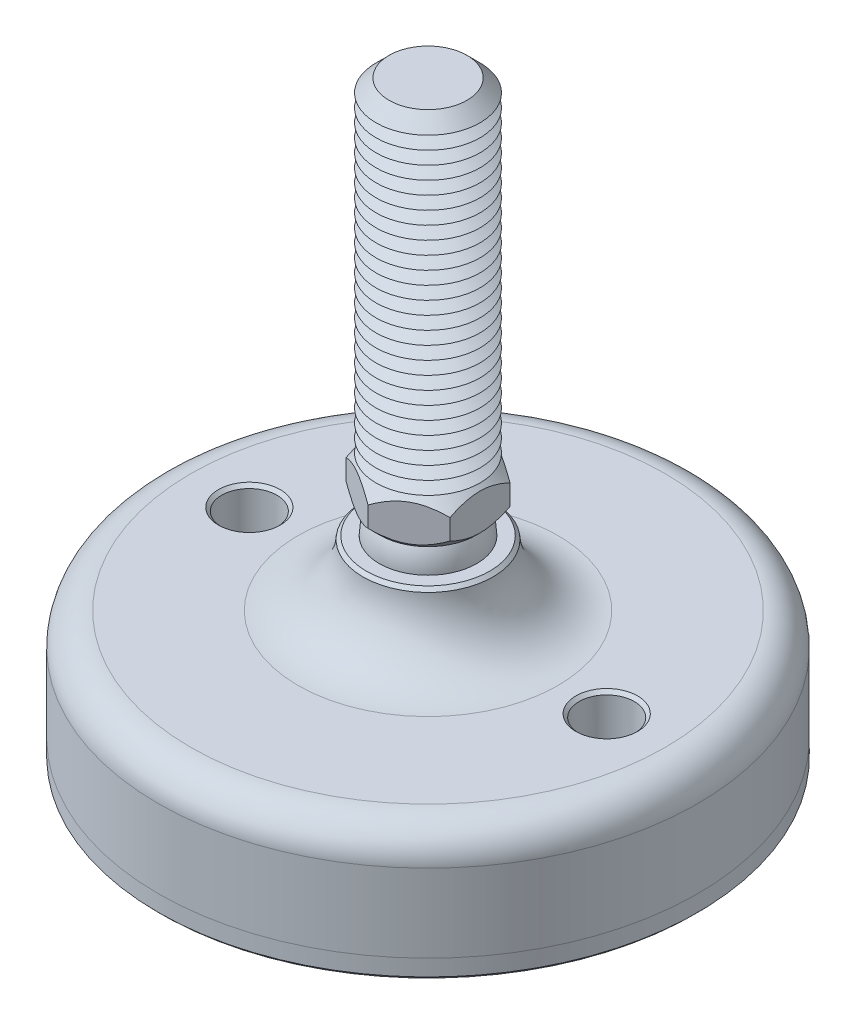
ISO-10303-21;
HEADER;
FILE_DESCRIPTION(('STEP AP214'),'2;1');
FILE_NAME('part.step','',(''),(''),'','','');
FILE_SCHEMA(('AUTOMOTIVE_DESIGN { 1 0 10303 214 1 1 1 1 }'));
ENDSEC;
DATA;
#1=APPLICATION_CONTEXT('core data for automotive mechanical design processes');
#2=APPLICATION_PROTOCOL_DEFINITION('international standard','automotive_design',2000,#1);
#3=PRODUCT_CONTEXT('',#1,'mechanical');
#4=PRODUCT('Part','Part','',(#3));
#5=PRODUCT_RELATED_PRODUCT_CATEGORY('part','',(#4));
#6=PRODUCT_DEFINITION_FORMATION('','',#4);
#7=PRODUCT_DEFINITION_CONTEXT('part definition',#1,'design');
#8=PRODUCT_DEFINITION('design','',#6,#7);
#9=PRODUCT_DEFINITION_SHAPE('','',#8);
#10=(LENGTH_UNIT() NAMED_UNIT(*) SI_UNIT(.MILLI.,.METRE.));
#11=(NAMED_UNIT(*) PLANE_ANGLE_UNIT() SI_UNIT($,.RADIAN.));
#12=(NAMED_UNIT(*) SI_UNIT($,.STERADIAN.) SOLID_ANGLE_UNIT());
#13=UNCERTAINTY_MEASURE_WITH_UNIT(LENGTH_MEASURE(1.E-05),#10,'distance_accuracy_value','');
#14=(GEOMETRIC_REPRESENTATION_CONTEXT(3) GLOBAL_UNCERTAINTY_ASSIGNED_CONTEXT((#13)) GLOBAL_UNIT_ASSIGNED_CONTEXT((#10,
#11,#12)) REPRESENTATION_CONTEXT('',''));
#15=CARTESIAN_POINT('',(0.,0.,0.));
#16=DIRECTION('',(0.,0.,1.));
#17=DIRECTION('',(1.,0.,0.));
#18=AXIS2_PLACEMENT_3D('',#15,#16,#17);
#19=CARTESIAN_POINT('',(0.,-27.,0.));
#20=DIRECTION('',(0.,1.,0.));
#21=DIRECTION('',(0.,0.,1.));
#22=AXIS2_PLACEMENT_3D('',#19,#20,#21);
#23=PLANE('',#22);
#24=CARTESIAN_POINT('',(-27.5,-27.,0.));
#25=DIRECTION('',(0.,1.,0.));
#26=DIRECTION('',(0.,0.,1.));
#27=AXIS2_PLACEMENT_3D('',#24,#25,#26);
#28=CIRCLE('',#27,4.25000000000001);
#29=CARTESIAN_POINT('',(-27.5,-27.,4.25000000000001));
#30=VERTEX_POINT('',#29);
#31=EDGE_CURVE('P0_E43',#30,#30,#28,.T.);
#32=ORIENTED_EDGE('',*,*,#31,.F.);
#33=EDGE_LOOP('',(#32));
#34=FACE_BOUND('',#33,.T.);
#35=CARTESIAN_POINT('',(27.5,-27.,0.));
#36=DIRECTION('',(0.,1.,0.));
#37=DIRECTION('',(0.,0.,1.));
#38=AXIS2_PLACEMENT_3D('',#35,#36,#37);
#39=CIRCLE('',#38,4.25000000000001);
#40=CARTESIAN_POINT('',(27.5,-27.,4.25000000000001));
#41=VERTEX_POINT('',#40);
#42=EDGE_CURVE('P0_E44',#41,#41,#39,.T.);
#43=ORIENTED_EDGE('',*,*,#42,.F.);
#44=EDGE_LOOP('',(#43));
#45=FACE_BOUND('',#44,.T.);
#46=CARTESIAN_POINT('',(0.,-27.,0.));
#47=DIRECTION('',(0.,1.,0.));
#48=DIRECTION('',(0.,0.,1.));
#49=AXIS2_PLACEMENT_3D('',#46,#47,#48);
#50=CIRCLE('',#49,41.5);
#51=CARTESIAN_POINT('',(0.,-27.,41.5));
#52=VERTEX_POINT('',#51);
#53=EDGE_CURVE('P0_E40',#52,#52,#50,.T.);
#54=ORIENTED_EDGE('',*,*,#53,.T.);
#55=EDGE_LOOP('',(#54));
#56=FACE_BOUND('',#55,.T.);
#57=ADVANCED_FACE('P0_F14',(#34,#45,#56),#23,.T.);
#58=CARTESIAN_POINT('',(0.,48.1654938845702,0.));
#59=DIRECTION('',(0.,1.,0.));
#60=DIRECTION('',(0.,0.,1.));
#61=AXIS2_PLACEMENT_3D('',#58,#59,#60);
#62=CYLINDRICAL_SURFACE('',#61,41.5);
#63=CARTESIAN_POINT('',(0.,-29.5,0.));
#64=DIRECTION('',(0.,-1.,0.));
#65=DIRECTION('',(0.,0.,-1.));
#66=AXIS2_PLACEMENT_3D('',#63,#64,#65);
#67=CIRCLE('',#66,41.5);
#68=CARTESIAN_POINT('',(0.,-29.5,-41.5));
#69=VERTEX_POINT('',#68);
#70=EDGE_CURVE('P0_E37',#69,#69,#67,.F.);
#71=ORIENTED_EDGE('',*,*,#70,.T.);
#72=EDGE_LOOP('',(#71));
#73=FACE_BOUND('',#72,.T.);
#74=ORIENTED_EDGE('',*,*,#53,.F.);
#75=EDGE_LOOP('',(#74));
#76=FACE_BOUND('',#75,.T.);
#77=ADVANCED_FACE('P0_F54',(#73,#76),#62,.T.);
#78=CARTESIAN_POINT('',(0.,-30.,41.5));
#79=DIRECTION('',(0.,-1.,0.));
#80=DIRECTION('',(0.,0.,-1.));
#81=AXIS2_PLACEMENT_3D('',#78,#79,#80);
#82=PLANE('',#81);
#83=CARTESIAN_POINT('',(27.5,-30.,0.));
#84=DIRECTION('',(0.,-1.,0.));
#85=DIRECTION('',(0.,0.,-1.));
#86=AXIS2_PLACEMENT_3D('',#83,#84,#85);
#87=CIRCLE('',#86,4.75);
#88=CARTESIAN_POINT('',(27.5,-30.,-4.75000000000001));
#89=VERTEX_POINT('',#88);
#90=EDGE_CURVE('P0_E25',#89,#89,#87,.F.);
#91=ORIENTED_EDGE('',*,*,#90,.T.);
#92=EDGE_LOOP('',(#91));
#93=FACE_BOUND('',#92,.T.);
#94=CARTESIAN_POINT('',(-27.5,-30.,0.));
#95=DIRECTION('',(0.,-1.,0.));
#96=DIRECTION('',(0.,0.,-1.));
#97=AXIS2_PLACEMENT_3D('',#94,#95,#96);
#98=CIRCLE('',#97,4.75);
#99=CARTESIAN_POINT('',(-27.5,-30.,-4.75));
#100=VERTEX_POINT('',#99);
#101=EDGE_CURVE('P0_E29',#100,#100,#98,.F.);
#102=ORIENTED_EDGE('',*,*,#101,.T.);
#103=EDGE_LOOP('',(#102));
#104=FACE_BOUND('',#103,.T.);
#105=CARTESIAN_POINT('',(0.,-30.,0.));
#106=DIRECTION('',(0.,-1.,0.));
#107=DIRECTION('',(0.,0.,-1.));
#108=AXIS2_PLACEMENT_3D('',#105,#106,#107);
#109=CIRCLE('',#108,41.);
#110=CARTESIAN_POINT('',(0.,-30.,-41.));
#111=VERTEX_POINT('',#110);
#112=EDGE_CURVE('P0_E34',#111,#111,#109,.T.);
#113=ORIENTED_EDGE('',*,*,#112,.T.);
#114=EDGE_LOOP('',(#113));
#115=FACE_BOUND('',#114,.T.);
#116=ADVANCED_FACE('P0_F61',(#93,#104,#115),#82,.T.);
#117=CARTESIAN_POINT('',(0.,-29.5,0.));
#118=DIRECTION('',(0.,1.,0.));
#119=DIRECTION('',(0.,0.,1.));
#120=AXIS2_PLACEMENT_3D('',#117,#118,#119);
#121=CONICAL_SURFACE('',#120,41.5,0.785398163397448);
#122=ORIENTED_EDGE('',*,*,#112,.F.);
#123=EDGE_LOOP('',(#122));
#124=FACE_BOUND('',#123,.T.);
#125=ORIENTED_EDGE('',*,*,#70,.F.);
#126=EDGE_LOOP('',(#125));
#127=FACE_BOUND('',#126,.T.);
#128=ADVANCED_FACE('P0_F68',(#124,#127),#121,.T.);
#129=CARTESIAN_POINT('',(27.5,-30.,0.));
#130=DIRECTION('',(0.,1.,0.));
#131=DIRECTION('',(0.,0.,1.));
#132=AXIS2_PLACEMENT_3D('',#129,#130,#131);
#133=CYLINDRICAL_SURFACE('',#132,4.25000000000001);
#134=CARTESIAN_POINT('',(27.5,-29.5,0.));
#135=DIRECTION('',(0.,-1.,0.));
#136=DIRECTION('',(0.,0.,-1.));
#137=AXIS2_PLACEMENT_3D('',#134,#135,#136);
#138=CIRCLE('',#137,4.25000000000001);
#139=CARTESIAN_POINT('',(27.5,-29.5,-4.25000000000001));
#140=VERTEX_POINT('',#139);
#141=EDGE_CURVE('P0_E21',#140,#140,#138,.T.);
#142=ORIENTED_EDGE('',*,*,#141,.T.);
#143=EDGE_LOOP('',(#142));
#144=FACE_BOUND('',#143,.T.);
#145=ORIENTED_EDGE('',*,*,#42,.T.);
#146=EDGE_LOOP('',(#145));
#147=FACE_BOUND('',#146,.T.);
#148=ADVANCED_FACE('P0_F74',(#144,#147),#133,.F.);
#149=CARTESIAN_POINT('',(-27.5,-30.,0.));
#150=DIRECTION('',(0.,1.,0.));
#151=DIRECTION('',(0.,0.,1.));
#152=AXIS2_PLACEMENT_3D('',#149,#150,#151);
#153=CYLINDRICAL_SURFACE('',#152,4.25000000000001);
#154=CARTESIAN_POINT('',(-27.5,-29.5,0.));
#155=DIRECTION('',(0.,-1.,0.));
#156=DIRECTION('',(0.,0.,-1.));
#157=AXIS2_PLACEMENT_3D('',#154,#155,#156);
#158=CIRCLE('',#157,4.25000000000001);
#159=CARTESIAN_POINT('',(-27.5,-29.5,-4.25000000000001));
#160=VERTEX_POINT('',#159);
#161=EDGE_CURVE('P0_E10',#160,#160,#158,.T.);
#162=ORIENTED_EDGE('',*,*,#161,.T.);
#163=EDGE_LOOP('',(#162));
#164=FACE_BOUND('',#163,.T.);
#165=ORIENTED_EDGE('',*,*,#31,.T.);
#166=EDGE_LOOP('',(#165));
#167=FACE_BOUND('',#166,.T.);
#168=ADVANCED_FACE('P0_F50',(#164,#167),#153,.F.);
#169=CARTESIAN_POINT('',(27.5,-30.,0.));
#170=DIRECTION('',(0.,-1.,0.));
#171=DIRECTION('',(0.,0.,-1.));
#172=AXIS2_PLACEMENT_3D('',#169,#170,#171);
#173=CONICAL_SURFACE('',#172,4.75,0.785398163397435);
#174=ORIENTED_EDGE('',*,*,#141,.F.);
#175=EDGE_LOOP('',(#174));
#176=FACE_BOUND('',#175,.T.);
#177=ORIENTED_EDGE('',*,*,#90,.F.);
#178=EDGE_LOOP('',(#177));
#179=FACE_BOUND('',#178,.T.);
#180=ADVANCED_FACE('P0_F76',(#176,#179),#173,.F.);
#181=CARTESIAN_POINT('',(-27.5,-30.,0.));
#182=DIRECTION('',(0.,-1.,0.));
#183=DIRECTION('',(0.,0.,-1.));
#184=AXIS2_PLACEMENT_3D('',#181,#182,#183);
#185=CONICAL_SURFACE('',#184,4.75,0.785398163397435);
#186=ORIENTED_EDGE('',*,*,#161,.F.);
#187=EDGE_LOOP('',(#186));
#188=FACE_BOUND('',#187,.T.);
#189=ORIENTED_EDGE('',*,*,#101,.F.);
#190=EDGE_LOOP('',(#189));
#191=FACE_BOUND('',#190,.T.);
#192=ADVANCED_FACE('P0_F16',(#188,#191),#185,.F.);
#193=CLOSED_SHELL('',(#57,#77,#116,#128,#148,#168,#180,#192));
#194=MANIFOLD_SOLID_BREP('P0_B1',#193);
#195=CARTESIAN_POINT('',(0.,3.75,0.));
#196=DIRECTION('',(0.,1.,0.));
#197=DIRECTION('',(0.,0.,1.));
#198=AXIS2_PLACEMENT_3D('',#195,#196,#197);
#199=PLANE('',#198);
#200=CARTESIAN_POINT('',(0.,3.75,0.));
#201=DIRECTION('',(0.,1.,0.));
#202=DIRECTION('',(0.,0.,1.));
#203=AXIS2_PLACEMENT_3D('',#200,#201,#202);
#204=CIRCLE('',#203,7.41889346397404);
#205=CARTESIAN_POINT('',(0.,3.75,7.41889346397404));
#206=VERTEX_POINT('',#205);
#207=EDGE_CURVE('P1_E211',#206,#206,#204,.T.);
#208=ORIENTED_EDGE('',*,*,#207,.F.);
#209=EDGE_LOOP('',(#208));
#210=FACE_BOUND('',#209,.T.);
#211=CARTESIAN_POINT('',(0.,3.75,0.));
#212=DIRECTION('',(0.,1.,0.));
#213=DIRECTION('',(0.,0.,1.));
#214=AXIS2_PLACEMENT_3D('',#211,#212,#213);
#215=CIRCLE('',#214,6.49519052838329);
#216=CARTESIAN_POINT('',(0.,3.75,6.49519052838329));
#217=VERTEX_POINT('',#216);
#218=EDGE_CURVE('P1_E24',#217,#217,#215,.F.);
#219=ORIENTED_EDGE('',*,*,#218,.F.);
#220=EDGE_LOOP('',(#219));
#221=FACE_BOUND('',#220,.T.);
#222=ADVANCED_FACE('P1_F16',(#210,#221),#199,.F.);
#223=CARTESIAN_POINT('',(0.,0.,0.));
#224=DIRECTION('',(0.,1.,0.));
#225=DIRECTION('',(0.,0.,-1.));
#226=AXIS2_PLACEMENT_3D('',#223,#224,#225);
#227=SPHERICAL_SURFACE('',#226,7.5);
#228=ORIENTED_EDGE('',*,*,#218,.T.);
#229=EDGE_LOOP('',(#228));
#230=FACE_BOUND('',#229,.T.);
#231=ADVANCED_FACE('P1_F201',(#230),#227,.T.);
#232=CARTESIAN_POINT('',(0.,3.75,0.));
#233=DIRECTION('',(0.,1.,0.));
#234=DIRECTION('',(0.,0.,1.));
#235=AXIS2_PLACEMENT_3D('',#232,#233,#234);
#236=CONICAL_SURFACE('',#235,7.41889346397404,0.785398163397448);
#237=ORIENTED_EDGE('',*,*,#207,.T.);
#238=EDGE_LOOP('',(#237));
#239=FACE_BOUND('',#238,.T.);
#240=CARTESIAN_POINT('',(-8.,8.67915108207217,-9.40607272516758));
#241=CARTESIAN_POINT('',(-8.,8.50538061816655,-9.17789983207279));
#242=CARTESIAN_POINT('',(-8.,8.33323236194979,-8.94847140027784));
#243=CARTESIAN_POINT('',(-8.,7.99291342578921,-8.48659991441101));
#244=CARTESIAN_POINT('',(-8.,7.82474372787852,-8.2541561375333));
#245=CARTESIAN_POINT('',(-8.,7.49191829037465,-7.78405005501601));
#246=CARTESIAN_POINT('',(-8.,7.32729980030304,-7.54636128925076));
#247=CARTESIAN_POINT('',(-8.,7.00401259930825,-7.066984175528));
#248=CARTESIAN_POINT('',(-8.,6.8453434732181,-6.82529610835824));
#249=CARTESIAN_POINT('',(-8.,6.52599353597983,-6.32262937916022));
#250=CARTESIAN_POINT('',(-8.,6.36576297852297,-6.06136321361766));
#251=CARTESIAN_POINT('',(-8.,6.05556462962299,-5.53271317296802));
#252=CARTESIAN_POINT('',(-8.,5.90559851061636,-5.26532831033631));
#253=CARTESIAN_POINT('',(-8.,5.61914583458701,-4.72442075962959));
#254=CARTESIAN_POINT('',(-8.,5.48261965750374,-4.45091921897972));
#255=CARTESIAN_POINT('',(-8.,5.22610459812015,-3.8963297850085));
#256=CARTESIAN_POINT('',(-8.,5.10610808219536,-3.61524546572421));
#257=CARTESIAN_POINT('',(-8.,4.89671738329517,-3.07036571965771));
#258=CARTESIAN_POINT('',(-8.,4.80554986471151,-2.80725883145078));
#259=CARTESIAN_POINT('',(-8.,4.64429812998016,-2.27454068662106));
#260=CARTESIAN_POINT('',(-8.,4.57421531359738,-2.00492899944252));
#261=CARTESIAN_POINT('',(-8.,4.46001937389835,-1.46539071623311));
#262=CARTESIAN_POINT('',(-8.,4.41544920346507,-1.19556248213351));
#263=CARTESIAN_POINT('',(-8.,4.35317465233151,-0.652806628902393));
#264=CARTESIAN_POINT('',(-8.,4.33546523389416,-0.379879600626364));
#265=CARTESIAN_POINT('',(-8.,4.3283167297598,0.155555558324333));
#266=CARTESIAN_POINT('',(-8.,4.33778869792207,0.418049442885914));
#267=CARTESIAN_POINT('',(-8.,4.38202991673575,0.940882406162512));
#268=CARTESIAN_POINT('',(-8.,4.41680155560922,1.2012212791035));
#269=CARTESIAN_POINT('',(-8.,4.51030475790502,1.72226548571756));
#270=CARTESIAN_POINT('',(-8.,4.56945097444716,1.9828951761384));
#271=CARTESIAN_POINT('',(-8.,4.7084911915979,2.498449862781));
#272=CARTESIAN_POINT('',(-8.,4.78838370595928,2.75337526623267));
#273=CARTESIAN_POINT('',(-8.,4.97226877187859,3.27629811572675));
#274=CARTESIAN_POINT('',(-8.,5.07763590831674,3.54380699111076));
#275=CARTESIAN_POINT('',(-8.,5.3045984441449,4.07191058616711));
#276=CARTESIAN_POINT('',(-8.,5.4262012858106,4.33250206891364));
#277=CARTESIAN_POINT('',(-8.,5.68274705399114,4.84802310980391));
#278=CARTESIAN_POINT('',(-8.,5.81773148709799,5.10293184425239));
#279=CARTESIAN_POINT('',(-8.,6.09806326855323,5.60689577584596));
#280=CARTESIAN_POINT('',(-8.,6.24340899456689,5.85595188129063));
#281=CARTESIAN_POINT('',(-8.,6.53502315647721,6.33676586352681));
#282=CARTESIAN_POINT('',(-8.,6.68088884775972,6.56876930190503));
#283=CARTESIAN_POINT('',(-8.,6.97879220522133,7.0287915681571));
#284=CARTESIAN_POINT('',(-8.,7.13083033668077,7.2568100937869));
#285=CARTESIAN_POINT('',(-8.,7.43872962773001,7.70754250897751));
#286=CARTESIAN_POINT('',(-8.,7.59454998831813,7.93028436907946));
#287=CARTESIAN_POINT('',(-8.,7.9103399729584,8.37271804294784));
#288=CARTESIAN_POINT('',(-8.,8.07030844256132,8.59241067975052));
#289=CARTESIAN_POINT('',(-8.,8.23197385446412,8.81082532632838));
#290=B_SPLINE_CURVE_WITH_KNOTS('',3,(#240,#241,#242,#243,#244,#245,#246,#247,#248,#249,#250,
#251,#252,#253,#254,#255,#256,#257,#258,#259,#260,#261,#262,#263,#264,#265,#266,#267,#268,#269,
#270,#271,#272,#273,#274,#275,#276,#277,#278,#279,#280,#281,#282,#283,#284,#285,#286,#287,#288,
#289),.UNSPECIFIED.,.F.,.F.,(4,2,2,2,2,2,2,2,2,2,2,2,2,2,2,2,2,2,2,2,2,2,2,2,4),(0.,
0.860441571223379,1.72109335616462,2.58840332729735,3.4556526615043,4.3749240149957,
5.2943447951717,6.21096847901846,7.12716742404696,7.96180281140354,8.7964935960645,
9.6157214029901,10.4347955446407,11.2215193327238,12.0083173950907,12.8090921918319,
13.6098096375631,14.471679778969,15.3339463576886,16.1989765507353,17.0638715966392,
17.8859014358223,18.7079933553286,19.5234450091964,20.3386721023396),.UNSPECIFIED.);
#291=CARTESIAN_POINT('',(-8.,5.56871084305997,-4.61880215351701));
#292=VERTEX_POINT('',#291);
#293=CARTESIAN_POINT('',(-8.,5.56871084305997,4.61880215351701));
#294=VERTEX_POINT('',#293);
#295=EDGE_CURVE('P1_E185',#292,#294,#290,.T.);
#296=ORIENTED_EDGE('',*,*,#295,.F.);
#297=CARTESIAN_POINT('',(0.000200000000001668,5.56882631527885,-9.23771977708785));
#298=CARTESIAN_POINT('',(-0.137352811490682,5.48941910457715,-9.15830362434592));
#299=CARTESIAN_POINT('',(-0.275962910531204,5.41244881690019,-9.07827704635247));
#300=CARTESIAN_POINT('',(-0.55550509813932,5.2641233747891,-8.91688328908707));
#301=CARTESIAN_POINT('',(-0.696438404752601,5.19277128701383,-8.83551540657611));
#302=CARTESIAN_POINT('',(-1.12434348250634,4.98764582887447,-8.58846429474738));
#303=CARTESIAN_POINT('',(-1.41493761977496,4.86367829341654,-8.42068969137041));
#304=CARTESIAN_POINT('',(-2.00094388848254,4.65139259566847,-8.08235881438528));
#305=CARTESIAN_POINT('',(-2.29620625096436,4.56253963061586,-7.91188900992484));
#306=CARTESIAN_POINT('',(-2.74395385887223,4.45975870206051,-7.65338180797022));
#307=CARTESIAN_POINT('',(-2.89386225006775,4.43059522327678,-7.5668321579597));
#308=CARTESIAN_POINT('',(-3.19494827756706,4.38309436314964,-7.39300005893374));
#309=CARTESIAN_POINT('',(-3.34612572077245,4.36475536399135,-7.30571772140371));
#310=CARTESIAN_POINT('',(-3.71452735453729,4.33400721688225,-7.09302093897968));
#311=CARTESIAN_POINT('',(-3.93214848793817,4.32755588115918,-6.96737731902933));
#312=CARTESIAN_POINT('',(-4.36699849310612,4.33838546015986,-6.71631655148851));
#313=CARTESIAN_POINT('',(-4.58422720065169,4.3556746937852,-6.59089949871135));
#314=CARTESIAN_POINT('',(-5.01663658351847,4.41296627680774,-6.3412478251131));
#315=CARTESIAN_POINT('',(-5.23181469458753,4.45299402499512,-6.21701468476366));
#316=CARTESIAN_POINT('',(-5.65847251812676,4.55358648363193,-5.97068367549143));
#317=CARTESIAN_POINT('',(-5.86995251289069,4.61414961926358,-5.84858564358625));
#318=CARTESIAN_POINT('',(-6.24536139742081,4.73874447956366,-5.63184322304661));
#319=CARTESIAN_POINT('',(-6.41012167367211,4.79949896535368,-5.53671883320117));
#320=CARTESIAN_POINT('',(-6.73668469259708,4.93079799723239,-5.34817758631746));
#321=CARTESIAN_POINT('',(-6.89848734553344,5.00134283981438,-5.25476078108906));
#322=CARTESIAN_POINT('',(-7.21862548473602,5.1506413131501,-5.06992894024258));
#323=CARTESIAN_POINT('',(-7.37697007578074,5.22936912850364,-4.97850864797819));
#324=CARTESIAN_POINT('',(-7.69072726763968,5.39400001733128,-4.79736084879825));
#325=CARTESIAN_POINT('',(-7.84614159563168,5.47989869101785,-4.70763234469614));
#326=CARTESIAN_POINT('',(-8.0002,5.56882631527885,-4.61868668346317));
#327=B_SPLINE_CURVE_WITH_KNOTS('',3,(#297,#298,#299,#300,#301,#302,#303,#304,#305,#306,#307,
#308,#309,#310,#311,#312,#313,#314,#315,#316,#317,#318,#319,#320,#321,#322,#323,#324,#325,#326),
.UNSPECIFIED.,.F.,.F.,(4,2,2,2,2,2,2,2,2,2,2,2,2,2,4),(0.,0.53269658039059,1.06568194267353,
2.13740664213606,3.19211397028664,3.71843331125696,4.24467396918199,4.99761238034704,
5.75081469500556,6.50485999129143,7.25884747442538,7.85770857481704,8.45658781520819,
9.05363199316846,9.65031250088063),.UNSPECIFIED.);
#328=CARTESIAN_POINT('',(0.,5.56871084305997,-9.23760430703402));
#329=VERTEX_POINT('',#328);
#330=EDGE_CURVE('P1_E179',#329,#292,#327,.T.);
#331=ORIENTED_EDGE('',*,*,#330,.F.);
#332=CARTESIAN_POINT('',(8.0002,5.56882631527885,-4.61868668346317));
#333=CARTESIAN_POINT('',(7.86264718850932,5.48941910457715,-4.69810283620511));
#334=CARTESIAN_POINT('',(7.72403708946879,5.4124488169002,-4.77812941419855));
#335=CARTESIAN_POINT('',(7.44449490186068,5.2641233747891,-4.93952317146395));
#336=CARTESIAN_POINT('',(7.3035615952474,5.19277128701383,-5.02089105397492));
#337=CARTESIAN_POINT('',(6.87565651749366,4.98764582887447,-5.26794216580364));
#338=CARTESIAN_POINT('',(6.58506238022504,4.86367829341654,-5.43571676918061));
#339=CARTESIAN_POINT('',(5.99905611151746,4.65139259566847,-5.77404764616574));
#340=CARTESIAN_POINT('',(5.70379374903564,4.56253963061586,-5.94451745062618));
#341=CARTESIAN_POINT('',(5.25604614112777,4.45975870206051,-6.2030246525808));
#342=CARTESIAN_POINT('',(5.10613774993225,4.43059522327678,-6.28957430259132));
#343=CARTESIAN_POINT('',(4.80505172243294,4.38309436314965,-6.46340640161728));
#344=CARTESIAN_POINT('',(4.65387427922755,4.36475536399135,-6.55068873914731));
#345=CARTESIAN_POINT('',(4.28547264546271,4.33400721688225,-6.76338552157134));
#346=CARTESIAN_POINT('',(4.06785151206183,4.32755588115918,-6.88902914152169));
#347=CARTESIAN_POINT('',(3.63300150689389,4.33838546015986,-7.14008990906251));
#348=CARTESIAN_POINT('',(3.41577279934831,4.3556746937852,-7.26550696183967));
#349=CARTESIAN_POINT('',(2.98336341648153,4.41296627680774,-7.51515863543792));
#350=CARTESIAN_POINT('',(2.76818530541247,4.45299402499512,-7.63939177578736));
#351=CARTESIAN_POINT('',(2.34152748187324,4.55358648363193,-7.88572278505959));
#352=CARTESIAN_POINT('',(2.13004748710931,4.61414961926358,-8.00782081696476));
#353=CARTESIAN_POINT('',(1.75463860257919,4.73874447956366,-8.22456323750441));
#354=CARTESIAN_POINT('',(1.58987832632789,4.79949896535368,-8.31968762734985));
#355=CARTESIAN_POINT('',(1.26331530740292,4.93079799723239,-8.50822887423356));
#356=CARTESIAN_POINT('',(1.10151265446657,5.00134283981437,-8.60164567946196));
#357=CARTESIAN_POINT('',(0.781374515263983,5.1506413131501,-8.78647752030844));
#358=CARTESIAN_POINT('',(0.623029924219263,5.22936912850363,-8.87789781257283));
#359=CARTESIAN_POINT('',(0.309272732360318,5.39400001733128,-9.05904561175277));
#360=CARTESIAN_POINT('',(0.153858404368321,5.47989869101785,-9.14877411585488));
#361=CARTESIAN_POINT('',(-0.000199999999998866,5.56882631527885,-9.23771977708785));
#362=B_SPLINE_CURVE_WITH_KNOTS('',3,(#332,#333,#334,#335,#336,#337,#338,#339,#340,#341,#342,
#343,#344,#345,#346,#347,#348,#349,#350,#351,#352,#353,#354,#355,#356,#357,#358,#359,#360,#361),
.UNSPECIFIED.,.F.,.F.,(4,2,2,2,2,2,2,2,2,2,2,2,2,2,4),(0.,0.532696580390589,1.06568194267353,
2.13740664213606,3.19211397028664,3.71843331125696,4.24467396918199,4.99761238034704,
5.75081469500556,6.50485999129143,7.25884747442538,7.85770857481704,8.45658781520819,
9.05363199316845,9.65031250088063),.UNSPECIFIED.);
#363=CARTESIAN_POINT('',(8.,5.56871084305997,-4.61880215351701));
#364=VERTEX_POINT('',#363);
#365=EDGE_CURVE('P1_E167',#364,#329,#362,.T.);
#366=ORIENTED_EDGE('',*,*,#365,.F.);
#367=CARTESIAN_POINT('',(8.,8.67915108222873,-9.40607272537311));
#368=CARTESIAN_POINT('',(8.,8.50538061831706,-9.17789983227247));
#369=CARTESIAN_POINT('',(8.,8.33323236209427,-8.94847140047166));
#370=CARTESIAN_POINT('',(8.,7.99291342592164,-8.48659991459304));
#371=CARTESIAN_POINT('',(8.,7.82474372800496,-8.25415613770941));
#372=CARTESIAN_POINT('',(8.,7.49191829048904,-7.78405005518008));
#373=CARTESIAN_POINT('',(8.,7.32729980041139,-7.54636128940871));
#374=CARTESIAN_POINT('',(8.,7.00401259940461,-7.0669841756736));
#375=CARTESIAN_POINT('',(8.,6.84534347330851,-6.82529610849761));
#376=CARTESIAN_POINT('',(8.,6.52599353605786,-6.32262937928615));
#377=CARTESIAN_POINT('',(8.,6.36576297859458,-6.06136321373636));
#378=CARTESIAN_POINT('',(8.,6.05556462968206,-5.53271317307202));
#379=CARTESIAN_POINT('',(8.,5.90559851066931,-5.26532831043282));
#380=CARTESIAN_POINT('',(8.,5.61914583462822,-4.72442075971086));
#381=CARTESIAN_POINT('',(8.,5.48261965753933,-4.45091921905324));
#382=CARTESIAN_POINT('',(8.,5.22610459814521,-3.8963297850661));
#383=CARTESIAN_POINT('',(8.,5.10610808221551,-3.61524546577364));
#384=CARTESIAN_POINT('',(8.,4.89671738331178,-3.07036571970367));
#385=CARTESIAN_POINT('',(8.,4.80554986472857,-2.8072588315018));
#386=CARTESIAN_POINT('',(8.,4.6442981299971,-2.27454068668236));
#387=CARTESIAN_POINT('',(8.,4.57421531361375,-2.00492899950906));
#388=CARTESIAN_POINT('',(8.,4.46001937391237,-1.46539071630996));
#389=CARTESIAN_POINT('',(8.,4.41544920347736,-1.19556248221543));
#390=CARTESIAN_POINT('',(8.,4.35317465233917,-0.65280662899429));
#391=CARTESIAN_POINT('',(8.,4.33546523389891,-0.379879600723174));
#392=CARTESIAN_POINT('',(8.,4.32831672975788,0.155555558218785));
#393=CARTESIAN_POINT('',(8.,4.33778869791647,0.41804944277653));
#394=CARTESIAN_POINT('',(8.,4.38202991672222,0.940882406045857));
#395=CARTESIAN_POINT('',(8.,4.41680155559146,1.20122127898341));
#396=CARTESIAN_POINT('',(8.,4.51030475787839,1.72226548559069));
#397=CARTESIAN_POINT('',(8.,4.56945097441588,1.9828951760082));
#398=CARTESIAN_POINT('',(8.,4.70849119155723,2.49844986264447));
#399=CARTESIAN_POINT('',(8.,4.78838370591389,2.75337526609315));
#400=CARTESIAN_POINT('',(8.,4.97226877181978,3.27629811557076));
#401=CARTESIAN_POINT('',(8.,5.07763590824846,3.5438069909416));
#402=CARTESIAN_POINT('',(8.,5.30459844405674,4.07191058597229));
#403=CARTESIAN_POINT('',(8.,5.42620128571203,4.33250206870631));
#404=CARTESIAN_POINT('',(8.,5.68274705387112,4.84802310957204));
#405=CARTESIAN_POINT('',(8.,5.81773148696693,5.10293184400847));
#406=CARTESIAN_POINT('',(8.,6.09806326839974,5.60689577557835));
#407=CARTESIAN_POINT('',(8.,6.24340899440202,5.85595188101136));
#408=CARTESIAN_POINT('',(8.,6.53502315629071,6.33676586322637));
#409=CARTESIAN_POINT('',(8.,6.68088884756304,6.56876930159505));
#410=CARTESIAN_POINT('',(8.,6.97879220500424,7.02879156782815));
#411=CARTESIAN_POINT('',(8.,7.13083033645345,7.25681009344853));
#412=CARTESIAN_POINT('',(8.,7.43872962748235,7.70754250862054));
#413=CARTESIAN_POINT('',(8.,7.59454998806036,7.93028436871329));
#414=CARTESIAN_POINT('',(8.,7.91033997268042,8.37271804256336));
#415=CARTESIAN_POINT('',(8.,8.07030844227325,8.59241067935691));
#416=CARTESIAN_POINT('',(8.,8.23197385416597,8.81082532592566));
#417=B_SPLINE_CURVE_WITH_KNOTS('',3,(#367,#368,#369,#370,#371,#372,#373,#374,#375,#376,#377,
#378,#379,#380,#381,#382,#383,#384,#385,#386,#387,#388,#389,#390,#391,#392,#393,#394,#395,#396,
#397,#398,#399,#400,#401,#402,#403,#404,#405,#406,#407,#408,#409,#410,#411,#412,#413,#414,#415,
#416),.UNSPECIFIED.,.F.,.F.,(4,2,2,2,2,2,2,2,2,2,2,2,2,2,2,2,2,2,2,2,2,2,2,2,4),(0.,
0.860441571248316,1.7210933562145,2.58840332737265,3.45565266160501,4.37492401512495,
5.2943447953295,6.21096847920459,7.12716742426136,7.96180281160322,8.79649359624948,
9.61572140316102,10.4347955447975,11.2215193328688,12.0083173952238,12.8090921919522,
13.6098096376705,14.4716797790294,15.3339463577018,16.1989765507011,17.0638715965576,
17.8859014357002,18.7079933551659,19.5234450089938,20.338672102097),.UNSPECIFIED.);
#418=CARTESIAN_POINT('',(8.,5.56871084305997,4.61880215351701));
#419=VERTEX_POINT('',#418);
#420=EDGE_CURVE('P1_E70',#419,#364,#417,.F.);
#421=ORIENTED_EDGE('',*,*,#420,.F.);
#422=CARTESIAN_POINT('',(-0.000199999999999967,5.56882631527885,9.23771977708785));
#423=CARTESIAN_POINT('',(0.137352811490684,5.48941910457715,9.15830362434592));
#424=CARTESIAN_POINT('',(0.275962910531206,5.41244881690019,9.07827704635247));
#425=CARTESIAN_POINT('',(0.555505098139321,5.2641233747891,8.91688328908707));
#426=CARTESIAN_POINT('',(0.696438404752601,5.19277128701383,8.83551540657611));
#427=CARTESIAN_POINT('',(1.12434348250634,4.98764582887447,8.58846429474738));
#428=CARTESIAN_POINT('',(1.41493761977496,4.86367829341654,8.42068969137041));
#429=CARTESIAN_POINT('',(2.00094388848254,4.65139259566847,8.08235881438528));
#430=CARTESIAN_POINT('',(2.29620625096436,4.56253963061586,7.91188900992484));
#431=CARTESIAN_POINT('',(2.74395385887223,4.45975870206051,7.65338180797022));
#432=CARTESIAN_POINT('',(2.89386225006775,4.43059522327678,7.5668321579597));
#433=CARTESIAN_POINT('',(3.19494827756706,4.38309436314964,7.39300005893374));
#434=CARTESIAN_POINT('',(3.34612572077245,4.36475536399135,7.30571772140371));
#435=CARTESIAN_POINT('',(3.71452735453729,4.33400721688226,7.09302093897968));
#436=CARTESIAN_POINT('',(3.93214848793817,4.32755588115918,6.96737731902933));
#437=CARTESIAN_POINT('',(4.36699849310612,4.33838546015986,6.71631655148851));
#438=CARTESIAN_POINT('',(4.58422720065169,4.3556746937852,6.59089949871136));
#439=CARTESIAN_POINT('',(5.01663658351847,4.41296627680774,6.3412478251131));
#440=CARTESIAN_POINT('',(5.23181469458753,4.45299402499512,6.21701468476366));
#441=CARTESIAN_POINT('',(5.65847251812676,4.55358648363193,5.97068367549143));
#442=CARTESIAN_POINT('',(5.86995251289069,4.61414961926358,5.84858564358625));
#443=CARTESIAN_POINT('',(6.24536139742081,4.73874447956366,5.63184322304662));
#444=CARTESIAN_POINT('',(6.41012167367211,4.79949896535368,5.53671883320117));
#445=CARTESIAN_POINT('',(6.73668469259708,4.93079799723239,5.34817758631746));
#446=CARTESIAN_POINT('',(6.89848734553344,5.00134283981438,5.25476078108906));
#447=CARTESIAN_POINT('',(7.21862548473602,5.1506413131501,5.06992894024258));
#448=CARTESIAN_POINT('',(7.37697007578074,5.22936912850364,4.97850864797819));
#449=CARTESIAN_POINT('',(7.69072726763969,5.39400001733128,4.79736084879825));
#450=CARTESIAN_POINT('',(7.84614159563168,5.47989869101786,4.70763234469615));
#451=CARTESIAN_POINT('',(8.0002,5.56882631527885,4.61868668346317));
#452=B_SPLINE_CURVE_WITH_KNOTS('',3,(#422,#423,#424,#425,#426,#427,#428,#429,#430,#431,#432,
#433,#434,#435,#436,#437,#438,#439,#440,#441,#442,#443,#444,#445,#446,#447,#448,#449,#450,#451),
.UNSPECIFIED.,.F.,.F.,(4,2,2,2,2,2,2,2,2,2,2,2,2,2,4),(0.,0.532696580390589,1.06568194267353,
2.13740664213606,3.19211397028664,3.71843331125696,4.24467396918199,4.99761238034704,
5.75081469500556,6.50485999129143,7.25884747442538,7.85770857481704,8.45658781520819,
9.05363199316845,9.65031250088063),.UNSPECIFIED.);
#453=CARTESIAN_POINT('',(0.,5.56871084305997,9.23760430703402));
#454=VERTEX_POINT('',#453);
#455=EDGE_CURVE('P1_E67',#454,#419,#452,.T.);
#456=ORIENTED_EDGE('',*,*,#455,.F.);
#457=CARTESIAN_POINT('',(-8.0002,5.56882631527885,4.61868668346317));
#458=CARTESIAN_POINT('',(-7.86264718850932,5.48941910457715,4.6981028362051));
#459=CARTESIAN_POINT('',(-7.7240370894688,5.41244881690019,4.77812941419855));
#460=CARTESIAN_POINT('',(-7.44449490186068,5.2641233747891,4.93952317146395));
#461=CARTESIAN_POINT('',(-7.3035615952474,5.19277128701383,5.02089105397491));
#462=CARTESIAN_POINT('',(-6.87565651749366,4.98764582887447,5.26794216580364));
#463=CARTESIAN_POINT('',(-6.58506238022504,4.86367829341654,5.43571676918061));
#464=CARTESIAN_POINT('',(-5.99905611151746,4.65139259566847,5.77404764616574));
#465=CARTESIAN_POINT('',(-5.70379374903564,4.56253963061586,5.94451745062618));
#466=CARTESIAN_POINT('',(-5.25604614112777,4.45975870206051,6.2030246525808));
#467=CARTESIAN_POINT('',(-5.10613774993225,4.43059522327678,6.28957430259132));
#468=CARTESIAN_POINT('',(-4.80505172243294,4.38309436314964,6.46340640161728));
#469=CARTESIAN_POINT('',(-4.65387427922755,4.36475536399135,6.55068873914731));
#470=CARTESIAN_POINT('',(-4.28547264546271,4.33400721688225,6.76338552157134));
#471=CARTESIAN_POINT('',(-4.06785151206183,4.32755588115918,6.88902914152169));
#472=CARTESIAN_POINT('',(-3.63300150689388,4.33838546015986,7.14008990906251));
#473=CARTESIAN_POINT('',(-3.4157727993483,4.3556746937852,7.26550696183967));
#474=CARTESIAN_POINT('',(-2.98336341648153,4.41296627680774,7.51515863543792));
#475=CARTESIAN_POINT('',(-2.76818530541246,4.45299402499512,7.63939177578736));
#476=CARTESIAN_POINT('',(-2.34152748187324,4.55358648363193,7.88572278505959));
#477=CARTESIAN_POINT('',(-2.13004748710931,4.61414961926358,8.00782081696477));
#478=CARTESIAN_POINT('',(-1.75463860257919,4.73874447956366,8.22456323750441));
#479=CARTESIAN_POINT('',(-1.58987832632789,4.79949896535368,8.31968762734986));
#480=CARTESIAN_POINT('',(-1.26331530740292,4.93079799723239,8.50822887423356));
#481=CARTESIAN_POINT('',(-1.10151265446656,5.00134283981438,8.60164567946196));
#482=CARTESIAN_POINT('',(-0.781374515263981,5.1506413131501,8.78647752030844));
#483=CARTESIAN_POINT('',(-0.623029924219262,5.22936912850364,8.87789781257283));
#484=CARTESIAN_POINT('',(-0.309272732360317,5.39400001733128,9.05904561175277));
#485=CARTESIAN_POINT('',(-0.15385840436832,5.47989869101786,9.14877411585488));
#486=CARTESIAN_POINT('',(0.000199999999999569,5.56882631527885,9.23771977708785));
#487=B_SPLINE_CURVE_WITH_KNOTS('',3,(#457,#458,#459,#460,#461,#462,#463,#464,#465,#466,#467,
#468,#469,#470,#471,#472,#473,#474,#475,#476,#477,#478,#479,#480,#481,#482,#483,#484,#485,#486),
.UNSPECIFIED.,.F.,.F.,(4,2,2,2,2,2,2,2,2,2,2,2,2,2,4),(0.,0.532696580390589,1.06568194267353,
2.13740664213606,3.19211397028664,3.71843331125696,4.244673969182,4.99761238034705,
5.75081469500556,6.50485999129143,7.25884747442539,7.85770857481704,8.4565878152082,
9.05363199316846,9.65031250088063),.UNSPECIFIED.);
#488=EDGE_CURVE('P1_E39',#294,#454,#487,.T.);
#489=ORIENTED_EDGE('',*,*,#488,.F.);
#490=EDGE_LOOP('',(#296,#331,#366,#421,#456,#489));
#491=FACE_BOUND('',#490,.T.);
#492=ADVANCED_FACE('P1_F68',(#239,#491),#236,.T.);
#493=CARTESIAN_POINT('',(-8.,11.,-4.61880215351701));
#494=DIRECTION('',(1.,0.,0.));
#495=DIRECTION('',(0.,0.,-1.));
#496=AXIS2_PLACEMENT_3D('',#493,#494,#495);
#497=PLANE('',#496);
#498=DIRECTION('',(0.,-1.,0.));
#499=VECTOR('',#498,1.);
#500=CARTESIAN_POINT('',(-8.,11.,4.61880215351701));
#501=LINE('',#500,#499);
#502=CARTESIAN_POINT('',(-8.,8.6905989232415,4.61880215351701));
#503=VERTEX_POINT('',#502);
#504=EDGE_CURVE('P1_E83',#503,#294,#501,.T.);
#505=ORIENTED_EDGE('',*,*,#504,.F.);
#506=CARTESIAN_POINT('',(-8.,5.72751350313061,-9.21177669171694));
#507=CARTESIAN_POINT('',(-8.,5.89682366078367,-8.98748005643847));
#508=CARTESIAN_POINT('',(-8.,6.06449721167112,-8.76192759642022));
#509=CARTESIAN_POINT('',(-8.,6.39583833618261,-8.30781564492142));
#510=CARTESIAN_POINT('',(-8.,6.55950489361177,-8.07925541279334));
#511=CARTESIAN_POINT('',(-8.,6.88326292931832,-7.6169606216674));
#512=CARTESIAN_POINT('',(-8.,7.04331688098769,-7.38319969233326));
#513=CARTESIAN_POINT('',(-8.,7.35745062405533,-6.91170999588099));
#514=CARTESIAN_POINT('',(-8.,7.51153083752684,-6.67398151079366));
#515=CARTESIAN_POINT('',(-8.,7.82098685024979,-6.18020562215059));
#516=CARTESIAN_POINT('',(-8.,7.97593334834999,-5.92388779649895));
#517=CARTESIAN_POINT('',(-8.,8.2756319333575,-5.40526917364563));
#518=CARTESIAN_POINT('',(-8.,8.42038240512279,-5.14296743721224));
#519=CARTESIAN_POINT('',(-8.,8.69656572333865,-4.61240539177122));
#520=CARTESIAN_POINT('',(-8.,8.82803773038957,-4.3441656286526));
#521=CARTESIAN_POINT('',(-8.,9.07472095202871,-3.80037048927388));
#522=CARTESIAN_POINT('',(-8.,9.18993952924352,-3.52481849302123));
#523=CARTESIAN_POINT('',(-8.,9.39155974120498,-2.98846490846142));
#524=CARTESIAN_POINT('',(-8.,9.47953421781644,-2.72826076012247));
#525=CARTESIAN_POINT('',(-8.,9.63460815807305,-2.20158778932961));
#526=CARTESIAN_POINT('',(-8.,9.70170618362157,-1.93511853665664));
#527=CARTESIAN_POINT('',(-8.,9.81040693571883,-1.40193852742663));
#528=CARTESIAN_POINT('',(-8.,9.85244648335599,-1.13531830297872));
#529=CARTESIAN_POINT('',(-8.,9.91021431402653,-0.599227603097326));
#530=CARTESIAN_POINT('',(-8.,9.92594711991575,-0.329757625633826));
#531=CARTESIAN_POINT('',(-8.,9.92993303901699,0.1996220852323));
#532=CARTESIAN_POINT('',(-8.,9.91916018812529,0.459524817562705));
#533=CARTESIAN_POINT('',(-8.,9.87287879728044,0.977104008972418));
#534=CARTESIAN_POINT('',(-8.,9.83736785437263,1.23478024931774));
#535=CARTESIAN_POINT('',(-8.,9.74294362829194,1.75039800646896));
#536=CARTESIAN_POINT('',(-8.,9.68363209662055,2.00826541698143));
#537=CARTESIAN_POINT('',(-8.,9.544769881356,2.51838158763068));
#538=CARTESIAN_POINT('',(-8.,9.46522089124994,2.77063081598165));
#539=CARTESIAN_POINT('',(-8.,9.28097494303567,3.29235438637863));
#540=CARTESIAN_POINT('',(-8.,9.17462363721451,3.56123855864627));
#541=CARTESIAN_POINT('',(-8.,8.94559365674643,4.09202258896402));
#542=CARTESIAN_POINT('',(-8.,8.82290737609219,4.35391912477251));
#543=CARTESIAN_POINT('',(-8.,8.56412641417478,4.87200778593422));
#544=CARTESIAN_POINT('',(-8.,8.42798963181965,5.12817871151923));
#545=CARTESIAN_POINT('',(-8.,8.14531665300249,5.63462540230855));
#546=CARTESIAN_POINT('',(-8.,7.99878211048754,5.88490209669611));
#547=CARTESIAN_POINT('',(-8.,7.70486004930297,6.36801618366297));
#548=CARTESIAN_POINT('',(-8.,7.55787799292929,6.60110156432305));
#549=CARTESIAN_POINT('',(-8.,7.25773303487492,7.06327081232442));
#550=CARTESIAN_POINT('',(-8.,7.10456966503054,7.29235437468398));
#551=CARTESIAN_POINT('',(-8.,6.79443207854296,7.74518607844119));
#552=CARTESIAN_POINT('',(-8.,6.63749892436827,7.96896244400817));
#553=CARTESIAN_POINT('',(-8.,6.31948249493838,8.413457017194));
#554=CARTESIAN_POINT('',(-8.,6.15840037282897,8.63417604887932));
#555=CARTESIAN_POINT('',(-8.,5.99562197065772,8.85361482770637));
#556=B_SPLINE_CURVE_WITH_KNOTS('',3,(#506,#507,#508,#509,#510,#511,#512,#513,#514,#515,#516,
#517,#518,#519,#520,#521,#522,#523,#524,#525,#526,#527,#528,#529,#530,#531,#532,#533,#534,#535,
#536,#537,#538,#539,#540,#541,#542,#543,#544,#545,#546,#547,#548,#549,#550,#551,#552,#553,#554,
#555),.UNSPECIFIED.,.F.,.F.,(4,2,2,2,2,2,2,2,2,2,2,2,2,2,2,2,2,2,2,2,2,2,2,2,4),(0.,
0.843090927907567,1.68639349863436,2.53623021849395,3.38600678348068,4.28435323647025,
5.18284167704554,6.07859779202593,6.97394682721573,7.79724439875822,8.62059867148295,
9.42914521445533,10.2375527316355,11.0166993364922,11.7959216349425,12.5887656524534,
13.381543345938,14.248326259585,15.1155141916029,15.9855080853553,16.8553639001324,
17.6819249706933,18.5085487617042,19.328457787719,20.1481413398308),.UNSPECIFIED.);
#557=CARTESIAN_POINT('',(-8.,8.6905989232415,-4.61880215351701));
#558=VERTEX_POINT('',#557);
#559=EDGE_CURVE('P1_E84',#503,#558,#556,.F.);
#560=ORIENTED_EDGE('',*,*,#559,.T.);
#561=DIRECTION('',(0.,-1.,0.));
#562=VECTOR('',#561,1.);
#563=CARTESIAN_POINT('',(-8.,11.,-4.61880215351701));
#564=LINE('',#563,#562);
#565=EDGE_CURVE('P1_E100',#558,#292,#564,.T.);
#566=ORIENTED_EDGE('',*,*,#565,.T.);
#567=ORIENTED_EDGE('',*,*,#295,.T.);
#568=EDGE_LOOP('',(#505,#560,#566,#567));
#569=FACE_BOUND('',#568,.T.);
#570=ADVANCED_FACE('P1_F193',(#569),#497,.F.);
#571=CARTESIAN_POINT('',(0.,11.,-9.23760430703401));
#572=DIRECTION('',(0.5,0.,0.866025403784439));
#573=DIRECTION('',(0.866025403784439,0.,-0.5));
#574=AXIS2_PLACEMENT_3D('',#571,#572,#573);
#575=PLANE('',#574);
#576=ORIENTED_EDGE('',*,*,#565,.F.);
#577=CARTESIAN_POINT('',(-8.0002,8.69048345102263,-4.61868668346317));
#578=CARTESIAN_POINT('',(-7.86264718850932,8.76989066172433,-4.69810283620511));
#579=CARTESIAN_POINT('',(-7.72403708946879,8.84686094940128,-4.77812941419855));
#580=CARTESIAN_POINT('',(-7.44449490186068,8.99518639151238,-4.93952317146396));
#581=CARTESIAN_POINT('',(-7.3035615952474,9.06653847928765,-5.02089105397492));
#582=CARTESIAN_POINT('',(-6.87565651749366,9.271663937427,-5.26794216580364));
#583=CARTESIAN_POINT('',(-6.58506238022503,9.39563147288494,-5.43571676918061));
#584=CARTESIAN_POINT('',(-5.99905611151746,9.60791717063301,-5.77404764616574));
#585=CARTESIAN_POINT('',(-5.70379374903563,9.69677013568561,-5.94451745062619));
#586=CARTESIAN_POINT('',(-5.25604614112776,9.79955106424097,-6.20302465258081));
#587=CARTESIAN_POINT('',(-5.10613774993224,9.8287145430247,-6.28957430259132));
#588=CARTESIAN_POINT('',(-4.80505172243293,9.87621540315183,-6.46340640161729));
#589=CARTESIAN_POINT('',(-4.65387427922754,9.89455440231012,-6.55068873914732));
#590=CARTESIAN_POINT('',(-4.2854726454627,9.92530254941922,-6.76338552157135));
#591=CARTESIAN_POINT('',(-4.06785151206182,9.93175388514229,-6.8890291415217));
#592=CARTESIAN_POINT('',(-3.63300150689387,9.92092430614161,-7.14008990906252));
#593=CARTESIAN_POINT('',(-3.41577279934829,9.90363507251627,-7.26550696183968));
#594=CARTESIAN_POINT('',(-2.98336341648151,9.84634348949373,-7.51515863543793));
#595=CARTESIAN_POINT('',(-2.76818530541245,9.80631574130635,-7.63939177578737));
#596=CARTESIAN_POINT('',(-2.34152748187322,9.70572328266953,-7.88572278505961));
#597=CARTESIAN_POINT('',(-2.13004748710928,9.64516014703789,-8.00782081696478));
#598=CARTESIAN_POINT('',(-1.75463860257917,9.5205652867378,-8.22456323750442));
#599=CARTESIAN_POINT('',(-1.58987832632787,9.45981080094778,-8.31968762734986));
#600=CARTESIAN_POINT('',(-1.2633153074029,9.32851176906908,-8.50822887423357));
#601=CARTESIAN_POINT('',(-1.10151265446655,9.25796692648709,-8.60164567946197));
#602=CARTESIAN_POINT('',(-0.781374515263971,9.10866845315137,-8.78647752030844));
#603=CARTESIAN_POINT('',(-0.623029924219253,9.02994063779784,-8.87789781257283));
#604=CARTESIAN_POINT('',(-0.309272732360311,8.86530974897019,-9.05904561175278));
#605=CARTESIAN_POINT('',(-0.153858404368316,8.77941107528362,-9.14877411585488));
#606=CARTESIAN_POINT('',(0.000200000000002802,8.69048345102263,-9.23771977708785));
#607=B_SPLINE_CURVE_WITH_KNOTS('',3,(#577,#578,#579,#580,#581,#582,#583,#584,#585,#586,#587,
#588,#589,#590,#591,#592,#593,#594,#595,#596,#597,#598,#599,#600,#601,#602,#603,#604,#605,#606),
.UNSPECIFIED.,.F.,.F.,(4,2,2,2,2,2,2,2,2,2,2,2,2,2,4),(0.,0.532696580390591,1.06568194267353,
2.13740664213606,3.19211397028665,3.71843331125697,4.24467396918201,4.99761238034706,
5.75081469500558,6.50485999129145,7.25884747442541,7.85770857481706,8.4565878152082,
9.05363199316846,9.65031250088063),.UNSPECIFIED.);
#608=CARTESIAN_POINT('',(0.,8.6905989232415,-9.23760430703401));
#609=VERTEX_POINT('',#608);
#610=EDGE_CURVE('P1_E31',#558,#609,#607,.T.);
#611=ORIENTED_EDGE('',*,*,#610,.T.);
#612=DIRECTION('',(0.,-1.,0.));
#613=VECTOR('',#612,1.);
#614=CARTESIAN_POINT('',(0.,11.,-9.23760430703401));
#615=LINE('',#614,#613);
#616=EDGE_CURVE('P1_E97',#609,#329,#615,.T.);
#617=ORIENTED_EDGE('',*,*,#616,.T.);
#618=ORIENTED_EDGE('',*,*,#330,.T.);
#619=EDGE_LOOP('',(#576,#611,#617,#618));
#620=FACE_BOUND('',#619,.T.);
#621=ADVANCED_FACE('P1_F190',(#620),#575,.F.);
#622=CARTESIAN_POINT('',(8.,11.,-4.61880215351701));
#623=DIRECTION('',(-0.5,0.,0.866025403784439));
#624=DIRECTION('',(0.866025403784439,0.,0.5));
#625=AXIS2_PLACEMENT_3D('',#622,#623,#624);
#626=PLANE('',#625);
#627=ORIENTED_EDGE('',*,*,#616,.F.);
#628=CARTESIAN_POINT('',(-0.000199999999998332,8.69048345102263,-9.23771977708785));
#629=CARTESIAN_POINT('',(0.137352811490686,8.76989066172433,-9.15830362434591));
#630=CARTESIAN_POINT('',(0.275962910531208,8.84686094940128,-9.07827704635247));
#631=CARTESIAN_POINT('',(0.555505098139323,8.99518639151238,-8.91688328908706));
#632=CARTESIAN_POINT('',(0.696438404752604,9.06653847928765,-8.8355154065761));
#633=CARTESIAN_POINT('',(1.12434348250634,9.27166393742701,-8.58846429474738));
#634=CARTESIAN_POINT('',(1.41493761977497,9.39563147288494,-8.42068969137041));
#635=CARTESIAN_POINT('',(2.00094388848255,9.60791717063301,-8.08235881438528));
#636=CARTESIAN_POINT('',(2.29620625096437,9.69677013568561,-7.91188900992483));
#637=CARTESIAN_POINT('',(2.74395385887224,9.79955106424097,-7.65338180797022));
#638=CARTESIAN_POINT('',(2.89386225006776,9.8287145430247,-7.5668321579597));
#639=CARTESIAN_POINT('',(3.19494827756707,9.87621540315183,-7.39300005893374));
#640=CARTESIAN_POINT('',(3.34612572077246,9.89455440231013,-7.3057177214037));
#641=CARTESIAN_POINT('',(3.7145273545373,9.92530254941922,-7.09302093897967));
#642=CARTESIAN_POINT('',(3.93214848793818,9.9317538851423,-6.96737731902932));
#643=CARTESIAN_POINT('',(4.36699849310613,9.92092430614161,-6.7163165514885));
#644=CARTESIAN_POINT('',(4.58422720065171,9.90363507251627,-6.59089949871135));
#645=CARTESIAN_POINT('',(5.01663658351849,9.84634348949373,-6.34124782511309));
#646=CARTESIAN_POINT('',(5.23181469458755,9.80631574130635,-6.21701468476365));
#647=CARTESIAN_POINT('',(5.65847251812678,9.70572328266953,-5.97068367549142));
#648=CARTESIAN_POINT('',(5.86995251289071,9.64516014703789,-5.84858564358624));
#649=CARTESIAN_POINT('',(6.24536139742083,9.5205652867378,-5.6318432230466));
#650=CARTESIAN_POINT('',(6.41012167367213,9.45981080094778,-5.53671883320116));
#651=CARTESIAN_POINT('',(6.7366846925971,9.32851176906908,-5.34817758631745));
#652=CARTESIAN_POINT('',(6.89848734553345,9.25796692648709,-5.25476078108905));
#653=CARTESIAN_POINT('',(7.21862548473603,9.10866845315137,-5.06992894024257));
#654=CARTESIAN_POINT('',(7.37697007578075,9.02994063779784,-4.97850864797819));
#655=CARTESIAN_POINT('',(7.69072726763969,8.86530974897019,-4.79736084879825));
#656=CARTESIAN_POINT('',(7.84614159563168,8.77941107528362,-4.70763234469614));
#657=CARTESIAN_POINT('',(8.0002,8.69048345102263,-4.61868668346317));
#658=B_SPLINE_CURVE_WITH_KNOTS('',3,(#628,#629,#630,#631,#632,#633,#634,#635,#636,#637,#638,
#639,#640,#641,#642,#643,#644,#645,#646,#647,#648,#649,#650,#651,#652,#653,#654,#655,#656,#657),
.UNSPECIFIED.,.F.,.F.,(4,2,2,2,2,2,2,2,2,2,2,2,2,2,4),(0.,0.53269658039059,1.06568194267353,
2.13740664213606,3.19211397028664,3.71843331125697,4.244673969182,4.99761238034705,
5.75081469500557,6.50485999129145,7.25884747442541,7.85770857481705,8.4565878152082,
9.05363199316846,9.65031250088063),.UNSPECIFIED.);
#659=CARTESIAN_POINT('',(8.,8.6905989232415,-4.61880215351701));
#660=VERTEX_POINT('',#659);
#661=EDGE_CURVE('P1_E143',#609,#660,#658,.T.);
#662=ORIENTED_EDGE('',*,*,#661,.T.);
#663=DIRECTION('',(0.,-1.,0.));
#664=VECTOR('',#663,1.);
#665=CARTESIAN_POINT('',(8.,11.,-4.61880215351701));
#666=LINE('',#665,#664);
#667=EDGE_CURVE('P1_E92',#660,#364,#666,.T.);
#668=ORIENTED_EDGE('',*,*,#667,.T.);
#669=ORIENTED_EDGE('',*,*,#365,.T.);
#670=EDGE_LOOP('',(#627,#662,#668,#669));
#671=FACE_BOUND('',#670,.T.);
#672=ADVANCED_FACE('P1_F157',(#671),#626,.F.);
#673=CARTESIAN_POINT('',(8.,11.,4.61880215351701));
#674=DIRECTION('',(-1.,0.,0.));
#675=DIRECTION('',(0.,0.,1.));
#676=AXIS2_PLACEMENT_3D('',#673,#674,#675);
#677=PLANE('',#676);
#678=ORIENTED_EDGE('',*,*,#667,.F.);
#679=CARTESIAN_POINT('',(8.,5.72751350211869,-9.2117766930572));
#680=CARTESIAN_POINT('',(8.,5.89682365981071,-8.98748005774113));
#681=CARTESIAN_POINT('',(8.,6.06449721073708,-8.76192759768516));
#682=CARTESIAN_POINT('',(8.,6.39583833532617,-8.30781564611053));
#683=CARTESIAN_POINT('',(8.,6.55950489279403,-8.07925541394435));
#684=CARTESIAN_POINT('',(8.,6.88326292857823,-7.61696062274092));
#685=CARTESIAN_POINT('',(8.,7.04331688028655,-7.38319969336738));
#686=CARTESIAN_POINT('',(8.,7.35745062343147,-6.9117099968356));
#687=CARTESIAN_POINT('',(8.,7.51153083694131,-6.67398151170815));
#688=CARTESIAN_POINT('',(8.,7.82098684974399,-6.18020562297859));
#689=CARTESIAN_POINT('',(8.,7.97593334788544,-5.92388779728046));
#690=CARTESIAN_POINT('',(8.,8.27563193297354,-5.40526917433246));
#691=CARTESIAN_POINT('',(8.,8.42038240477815,-5.1429674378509));
#692=CARTESIAN_POINT('',(8.,8.69656572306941,-4.61240539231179));
#693=CARTESIAN_POINT('',(8.,8.82803773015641,-4.34416562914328));
#694=CARTESIAN_POINT('',(8.,9.07472095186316,-3.80037048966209));
#695=CARTESIAN_POINT('',(8.,9.18993952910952,-3.52481849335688));
#696=CARTESIAN_POINT('',(8.,9.39155974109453,-2.98846490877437));
#697=CARTESIAN_POINT('',(8.,9.47953421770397,-2.72826076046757));
#698=CARTESIAN_POINT('',(8.,9.63460815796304,-2.20158778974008));
#699=CARTESIAN_POINT('',(8.,9.70170618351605,-1.93511853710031));
#700=CARTESIAN_POINT('',(8.,9.81040693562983,-1.40193852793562));
#701=CARTESIAN_POINT('',(8.,9.85244648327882,-1.13531830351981));
#702=CARTESIAN_POINT('',(8.,9.91021431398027,-0.599227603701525));
#703=CARTESIAN_POINT('',(8.,9.92594711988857,-0.329757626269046));
#704=CARTESIAN_POINT('',(8.,9.92993303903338,0.199622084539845));
#705=CARTESIAN_POINT('',(8.,9.9191601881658,0.459524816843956));
#706=CARTESIAN_POINT('',(8.,9.87287879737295,0.977104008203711));
#707=CARTESIAN_POINT('',(8.,9.83736785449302,1.23478024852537));
#708=CARTESIAN_POINT('',(8.,9.74294362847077,1.75039800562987));
#709=CARTESIAN_POINT('',(8.,9.68363209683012,2.00826541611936));
#710=CARTESIAN_POINT('',(8.,9.54476988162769,2.51838158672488));
#711=CARTESIAN_POINT('',(8.,9.46522089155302,2.77063081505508));
#712=CARTESIAN_POINT('',(8.,9.28097494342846,3.29235438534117));
#713=CARTESIAN_POINT('',(8.,9.17462363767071,3.56123855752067));
#714=CARTESIAN_POINT('',(8.,8.94559365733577,4.09202258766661));
#715=CARTESIAN_POINT('',(8.,8.82290737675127,4.35391912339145));
#716=CARTESIAN_POINT('',(8.,8.56412641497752,4.87200778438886));
#717=CARTESIAN_POINT('',(8.,8.42798963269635,5.12817870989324));
#718=CARTESIAN_POINT('',(8.,8.1453166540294,5.63462540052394));
#719=CARTESIAN_POINT('',(8.,7.99878211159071,5.88490209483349));
#720=CARTESIAN_POINT('',(8.,7.70486005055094,6.36801618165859));
#721=CARTESIAN_POINT('',(8.,7.55787799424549,6.60110156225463));
#722=CARTESIAN_POINT('',(8.,7.25773303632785,7.06327081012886));
#723=CARTESIAN_POINT('',(8.,7.10456966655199,7.29235437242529));
#724=CARTESIAN_POINT('',(8.,6.79443208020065,7.74518607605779));
#725=CARTESIAN_POINT('',(8.,6.63749892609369,7.96896244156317));
#726=CARTESIAN_POINT('',(8.,6.31948249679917,8.41345701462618));
#727=CARTESIAN_POINT('',(8.,6.15840037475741,8.6341760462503));
#728=CARTESIAN_POINT('',(8.,5.99562197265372,8.85361482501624));
#729=B_SPLINE_CURVE_WITH_KNOTS('',3,(#679,#680,#681,#682,#683,#684,#685,#686,#687,#688,#689,
#690,#691,#692,#693,#694,#695,#696,#697,#698,#699,#700,#701,#702,#703,#704,#705,#706,#707,#708,
#709,#710,#711,#712,#713,#714,#715,#716,#717,#718,#719,#720,#721,#722,#723,#724,#725,#726,#727,
#728),.UNSPECIFIED.,.F.,.F.,(4,2,2,2,2,2,2,2,2,2,2,2,2,2,2,2,2,2,2,2,2,2,2,2,4),(0.,
0.843090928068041,1.68639349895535,2.53623021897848,3.38600678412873,4.28435323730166,
5.18284167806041,6.07859779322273,6.97394682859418,7.79724440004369,8.6205986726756,
9.42914521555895,10.2375527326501,11.0166993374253,11.7959216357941,12.5887656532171,
13.381543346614,14.2483262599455,15.1155141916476,15.9855080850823,16.8553638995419,
17.6819249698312,18.5085487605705,19.3284577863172,20.1481413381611),.UNSPECIFIED.);
#730=CARTESIAN_POINT('',(8.,8.6905989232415,4.61880215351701));
#731=VERTEX_POINT('',#730);
#732=EDGE_CURVE('P1_E148',#660,#731,#729,.T.);
#733=ORIENTED_EDGE('',*,*,#732,.T.);
#734=DIRECTION('',(0.,-1.,0.));
#735=VECTOR('',#734,1.);
#736=CARTESIAN_POINT('',(8.,11.,4.61880215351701));
#737=LINE('',#736,#735);
#738=EDGE_CURVE('P1_E89',#731,#419,#737,.T.);
#739=ORIENTED_EDGE('',*,*,#738,.T.);
#740=ORIENTED_EDGE('',*,*,#420,.T.);
#741=EDGE_LOOP('',(#678,#733,#739,#740));
#742=FACE_BOUND('',#741,.T.);
#743=ADVANCED_FACE('P1_F154',(#742),#677,.F.);
#744=CARTESIAN_POINT('',(0.,11.,9.23760430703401));
#745=DIRECTION('',(-0.5,0.,-0.866025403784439));
#746=DIRECTION('',(-0.866025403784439,0.,0.5));
#747=AXIS2_PLACEMENT_3D('',#744,#745,#746);
#748=PLANE('',#747);
#749=ORIENTED_EDGE('',*,*,#738,.F.);
#750=CARTESIAN_POINT('',(8.0002,8.69048345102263,4.61868668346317));
#751=CARTESIAN_POINT('',(7.86264718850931,8.76989066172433,4.69810283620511));
#752=CARTESIAN_POINT('',(7.72403708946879,8.84686094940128,4.77812941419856));
#753=CARTESIAN_POINT('',(7.44449490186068,8.99518639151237,4.93952317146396));
#754=CARTESIAN_POINT('',(7.30356159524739,9.06653847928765,5.02089105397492));
#755=CARTESIAN_POINT('',(6.87565651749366,9.271663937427,5.26794216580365));
#756=CARTESIAN_POINT('',(6.58506238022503,9.39563147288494,5.43571676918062));
#757=CARTESIAN_POINT('',(5.99905611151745,9.607917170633,5.77404764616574));
#758=CARTESIAN_POINT('',(5.70379374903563,9.69677013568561,5.94451745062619));
#759=CARTESIAN_POINT('',(5.25604614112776,9.79955106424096,6.20302465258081));
#760=CARTESIAN_POINT('',(5.10613774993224,9.82871454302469,6.28957430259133));
#761=CARTESIAN_POINT('',(4.80505172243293,9.87621540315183,6.46340640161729));
#762=CARTESIAN_POINT('',(4.65387427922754,9.89455440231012,6.55068873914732));
#763=CARTESIAN_POINT('',(4.2854726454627,9.92530254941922,6.76338552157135));
#764=CARTESIAN_POINT('',(4.06785151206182,9.93175388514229,6.8890291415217));
#765=CARTESIAN_POINT('',(3.63300150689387,9.92092430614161,7.14008990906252));
#766=CARTESIAN_POINT('',(3.41577279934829,9.90363507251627,7.26550696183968));
#767=CARTESIAN_POINT('',(2.98336341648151,9.84634348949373,7.51515863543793));
#768=CARTESIAN_POINT('',(2.76818530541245,9.80631574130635,7.63939177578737));
#769=CARTESIAN_POINT('',(2.34152748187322,9.70572328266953,7.88572278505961));
#770=CARTESIAN_POINT('',(2.13004748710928,9.64516014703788,8.00782081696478));
#771=CARTESIAN_POINT('',(1.75463860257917,9.5205652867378,8.22456323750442));
#772=CARTESIAN_POINT('',(1.58987832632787,9.45981080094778,8.31968762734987));
#773=CARTESIAN_POINT('',(1.2633153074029,9.32851176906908,8.50822887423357));
#774=CARTESIAN_POINT('',(1.10151265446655,9.25796692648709,8.60164567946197));
#775=CARTESIAN_POINT('',(0.781374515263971,9.10866845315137,8.78647752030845));
#776=CARTESIAN_POINT('',(0.623029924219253,9.02994063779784,8.87789781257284));
#777=CARTESIAN_POINT('',(0.309272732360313,8.86530974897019,9.05904561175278));
#778=CARTESIAN_POINT('',(0.153858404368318,8.77941107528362,9.14877411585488));
#779=CARTESIAN_POINT('',(-0.000199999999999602,8.69048345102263,9.23771977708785));
#780=B_SPLINE_CURVE_WITH_KNOTS('',3,(#750,#751,#752,#753,#754,#755,#756,#757,#758,#759,#760,
#761,#762,#763,#764,#765,#766,#767,#768,#769,#770,#771,#772,#773,#774,#775,#776,#777,#778,#779),
.UNSPECIFIED.,.F.,.F.,(4,2,2,2,2,2,2,2,2,2,2,2,2,2,4),(0.,0.53269658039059,1.06568194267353,
2.13740664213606,3.19211397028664,3.71843331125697,4.244673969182,4.99761238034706,
5.75081469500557,6.50485999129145,7.25884747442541,7.85770857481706,8.4565878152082,
9.05363199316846,9.65031250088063),.UNSPECIFIED.);
#781=CARTESIAN_POINT('',(0.,8.6905989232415,9.23760430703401));
#782=VERTEX_POINT('',#781);
#783=EDGE_CURVE('P1_E88',#731,#782,#780,.T.);
#784=ORIENTED_EDGE('',*,*,#783,.T.);
#785=DIRECTION('',(0.,-1.,0.));
#786=VECTOR('',#785,1.);
#787=CARTESIAN_POINT('',(0.,11.,9.23760430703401));
#788=LINE('',#787,#786);
#789=EDGE_CURVE('P1_E81',#782,#454,#788,.T.);
#790=ORIENTED_EDGE('',*,*,#789,.T.);
#791=ORIENTED_EDGE('',*,*,#455,.T.);
#792=EDGE_LOOP('',(#749,#784,#790,#791));
#793=FACE_BOUND('',#792,.T.);
#794=ADVANCED_FACE('P1_F87',(#793),#748,.F.);
#795=CARTESIAN_POINT('',(-8.,11.,4.61880215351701));
#796=DIRECTION('',(0.5,0.,-0.866025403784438));
#797=DIRECTION('',(-0.866025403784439,0.,-0.5));
#798=AXIS2_PLACEMENT_3D('',#795,#796,#797);
#799=PLANE('',#798);
#800=ORIENTED_EDGE('',*,*,#789,.F.);
#801=CARTESIAN_POINT('',(0.000199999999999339,8.69048345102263,9.23771977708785));
#802=CARTESIAN_POINT('',(-0.137352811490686,8.76989066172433,9.15830362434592));
#803=CARTESIAN_POINT('',(-0.275962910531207,8.84686094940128,9.07827704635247));
#804=CARTESIAN_POINT('',(-0.555505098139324,8.99518639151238,8.91688328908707));
#805=CARTESIAN_POINT('',(-0.696438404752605,9.06653847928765,8.8355154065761));
#806=CARTESIAN_POINT('',(-1.12434348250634,9.27166393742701,8.58846429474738));
#807=CARTESIAN_POINT('',(-1.41493761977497,9.39563147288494,8.42068969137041));
#808=CARTESIAN_POINT('',(-2.00094388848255,9.60791717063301,8.08235881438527));
#809=CARTESIAN_POINT('',(-2.29620625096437,9.69677013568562,7.91188900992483));
#810=CARTESIAN_POINT('',(-2.74395385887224,9.79955106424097,7.65338180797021));
#811=CARTESIAN_POINT('',(-2.89386225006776,9.8287145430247,7.56683215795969));
#812=CARTESIAN_POINT('',(-3.19494827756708,9.87621540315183,7.39300005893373));
#813=CARTESIAN_POINT('',(-3.34612572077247,9.89455440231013,7.3057177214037));
#814=CARTESIAN_POINT('',(-3.71452735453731,9.92530254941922,7.09302093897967));
#815=CARTESIAN_POINT('',(-3.93214848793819,9.9317538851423,6.96737731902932));
#816=CARTESIAN_POINT('',(-4.36699849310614,9.92092430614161,6.71631655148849));
#817=CARTESIAN_POINT('',(-4.58422720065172,9.90363507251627,6.59089949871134));
#818=CARTESIAN_POINT('',(-5.01663658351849,9.84634348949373,6.34124782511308));
#819=CARTESIAN_POINT('',(-5.23181469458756,9.80631574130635,6.21701468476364));
#820=CARTESIAN_POINT('',(-5.65847251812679,9.70572328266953,5.97068367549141));
#821=CARTESIAN_POINT('',(-5.86995251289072,9.64516014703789,5.84858564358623));
#822=CARTESIAN_POINT('',(-6.24536139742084,9.5205652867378,5.6318432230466));
#823=CARTESIAN_POINT('',(-6.41012167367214,9.45981080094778,5.53671883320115));
#824=CARTESIAN_POINT('',(-6.7366846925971,9.32851176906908,5.34817758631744));
#825=CARTESIAN_POINT('',(-6.89848734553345,9.25796692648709,5.25476078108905));
#826=CARTESIAN_POINT('',(-7.21862548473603,9.10866845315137,5.06992894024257));
#827=CARTESIAN_POINT('',(-7.37697007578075,9.02994063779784,4.97850864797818));
#828=CARTESIAN_POINT('',(-7.69072726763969,8.8653097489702,4.79736084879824));
#829=CARTESIAN_POINT('',(-7.84614159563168,8.77941107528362,4.70763234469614));
#830=CARTESIAN_POINT('',(-8.0002,8.69048345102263,4.61868668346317));
#831=B_SPLINE_CURVE_WITH_KNOTS('',3,(#801,#802,#803,#804,#805,#806,#807,#808,#809,#810,#811,
#812,#813,#814,#815,#816,#817,#818,#819,#820,#821,#822,#823,#824,#825,#826,#827,#828,#829,#830),
.UNSPECIFIED.,.F.,.F.,(4,2,2,2,2,2,2,2,2,2,2,2,2,2,4),(0.,0.53269658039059,1.06568194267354,
2.13740664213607,3.19211397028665,3.71843331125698,4.24467396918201,4.99761238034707,
5.75081469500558,6.50485999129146,7.25884747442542,7.85770857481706,8.45658781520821,
9.05363199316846,9.65031250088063),.UNSPECIFIED.);
#832=EDGE_CURVE('P1_E104',#782,#503,#831,.T.);
#833=ORIENTED_EDGE('',*,*,#832,.T.);
#834=ORIENTED_EDGE('',*,*,#504,.T.);
#835=ORIENTED_EDGE('',*,*,#488,.T.);
#836=EDGE_LOOP('',(#800,#833,#834,#835));
#837=FACE_BOUND('',#836,.T.);
#838=ADVANCED_FACE('P1_F79',(#837),#799,.F.);
#839=CARTESIAN_POINT('',(0.,8.6905989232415,0.));
#840=DIRECTION('',(0.,-1.,0.));
#841=DIRECTION('',(0.,0.,-1.));
#842=AXIS2_PLACEMENT_3D('',#839,#840,#841);
#843=CONICAL_SURFACE('',#842,9.23760430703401,0.785398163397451);
#844=CARTESIAN_POINT('',(0.,11.,0.));
#845=DIRECTION('',(0.,1.,0.));
#846=DIRECTION('',(0.,0.,1.));
#847=AXIS2_PLACEMENT_3D('',#844,#845,#846);
#848=CIRCLE('',#847,6.92820323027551);
#849=CARTESIAN_POINT('',(0.,11.,6.92820323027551));
#850=VERTEX_POINT('',#849);
#851=EDGE_CURVE('P1_E214',#850,#850,#848,.T.);
#852=ORIENTED_EDGE('',*,*,#851,.F.);
#853=EDGE_LOOP('',(#852));
#854=FACE_BOUND('',#853,.T.);
#855=ORIENTED_EDGE('',*,*,#783,.F.);
#856=ORIENTED_EDGE('',*,*,#732,.F.);
#857=ORIENTED_EDGE('',*,*,#661,.F.);
#858=ORIENTED_EDGE('',*,*,#610,.F.);
#859=ORIENTED_EDGE('',*,*,#559,.F.);
#860=ORIENTED_EDGE('',*,*,#832,.F.);
#861=EDGE_LOOP('',(#855,#856,#857,#858,#859,#860));
#862=FACE_BOUND('',#861,.T.);
#863=ADVANCED_FACE('P1_F117',(#854,#862),#843,.T.);
#864=CARTESIAN_POINT('',(0.,11.,0.));
#865=DIRECTION('',(0.,1.,0.));
#866=DIRECTION('',(0.,0.,1.));
#867=AXIS2_PLACEMENT_3D('',#864,#865,#866);
#868=PLANE('',#867);
#869=ORIENTED_EDGE('',*,*,#851,.T.);
#870=EDGE_LOOP('',(#869));
#871=FACE_BOUND('',#870,.T.);
#872=CARTESIAN_POINT('',(0.,11.,0.));
#873=DIRECTION('',(0.,1.,0.));
#874=DIRECTION('',(0.,0.,1.));
#875=AXIS2_PLACEMENT_3D('',#872,#873,#874);
#876=CIRCLE('',#875,8.);
#877=CARTESIAN_POINT('',(0.,11.,8.));
#878=VERTEX_POINT('',#877);
#879=EDGE_CURVE('P1_E215',#878,#878,#876,.T.);
#880=ORIENTED_EDGE('',*,*,#879,.F.);
#881=EDGE_LOOP('',(#880));
#882=FACE_BOUND('',#881,.T.);
#883=ADVANCED_FACE('P1_F122',(#871,#882),#868,.F.);
#884=CARTESIAN_POINT('',(0.,11.,0.));
#885=DIRECTION('',(0.,-1.,0.));
#886=DIRECTION('',(0.,0.,-1.));
#887=AXIS2_PLACEMENT_3D('',#884,#885,#886);
#888=CONICAL_SURFACE('',#887,8.,1.0471975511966);
#889=CARTESIAN_POINT('',(0.,12.,0.));
#890=DIRECTION('',(0.,1.,0.));
#891=DIRECTION('',(0.,0.,1.));
#892=AXIS2_PLACEMENT_3D('',#889,#890,#891);
#893=CIRCLE('',#892,6.26794919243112);
#894=CARTESIAN_POINT('',(0.,12.,6.26794919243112));
#895=VERTEX_POINT('',#894);
#896=EDGE_CURVE('P1_E219',#895,#895,#893,.T.);
#897=ORIENTED_EDGE('',*,*,#896,.F.);
#898=EDGE_LOOP('',(#897));
#899=FACE_BOUND('',#898,.T.);
#900=ORIENTED_EDGE('',*,*,#879,.T.);
#901=EDGE_LOOP('',(#900));
#902=FACE_BOUND('',#901,.T.);
#903=ADVANCED_FACE('P1_F648',(#899,#902),#888,.T.);
#904=CARTESIAN_POINT('',(0.,12.,0.));
#905=DIRECTION('',(0.,1.,0.));
#906=DIRECTION('',(0.,0.,1.));
#907=AXIS2_PLACEMENT_3D('',#904,#905,#906);
#908=CONICAL_SURFACE('',#907,6.26794919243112,1.0471975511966);
#909=CARTESIAN_POINT('',(0.,13.,0.));
#910=DIRECTION('',(0.,1.,0.));
#911=DIRECTION('',(0.,0.,1.));
#912=AXIS2_PLACEMENT_3D('',#909,#910,#911);
#913=CIRCLE('',#912,8.);
#914=CARTESIAN_POINT('',(0.,13.,8.));
#915=VERTEX_POINT('',#914);
#916=EDGE_CURVE('P1_E224',#915,#915,#913,.T.);
#917=ORIENTED_EDGE('',*,*,#916,.F.);
#918=EDGE_LOOP('',(#917));
#919=FACE_BOUND('',#918,.T.);
#920=ORIENTED_EDGE('',*,*,#896,.T.);
#921=EDGE_LOOP('',(#920));
#922=FACE_BOUND('',#921,.T.);
#923=ADVANCED_FACE('P1_F642',(#919,#922),#908,.T.);
#924=CARTESIAN_POINT('',(0.,13.,0.));
#925=DIRECTION('',(0.,-1.,0.));
#926=DIRECTION('',(0.,0.,-1.));
#927=AXIS2_PLACEMENT_3D('',#924,#925,#926);
#928=CONICAL_SURFACE('',#927,8.,1.0471975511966);
#929=CARTESIAN_POINT('',(0.,14.,0.));
#930=DIRECTION('',(0.,1.,0.));
#931=DIRECTION('',(0.,0.,1.));
#932=AXIS2_PLACEMENT_3D('',#929,#930,#931);
#933=CIRCLE('',#932,6.26794919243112);
#934=CARTESIAN_POINT('',(0.,14.,6.26794919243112));
#935=VERTEX_POINT('',#934);
#936=EDGE_CURVE('P1_E227',#935,#935,#933,.T.);
#937=ORIENTED_EDGE('',*,*,#936,.F.);
#938=EDGE_LOOP('',(#937));
#939=FACE_BOUND('',#938,.T.);
#940=ORIENTED_EDGE('',*,*,#916,.T.);
#941=EDGE_LOOP('',(#940));
#942=FACE_BOUND('',#941,.T.);
#943=ADVANCED_FACE('P1_F636',(#939,#942),#928,.T.);
#944=CARTESIAN_POINT('',(0.,14.,0.));
#945=DIRECTION('',(0.,1.,0.));
#946=DIRECTION('',(0.,0.,1.));
#947=AXIS2_PLACEMENT_3D('',#944,#945,#946);
#948=CONICAL_SURFACE('',#947,6.26794919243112,1.0471975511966);
#949=CARTESIAN_POINT('',(0.,15.,0.));
#950=DIRECTION('',(0.,1.,0.));
#951=DIRECTION('',(0.,0.,1.));
#952=AXIS2_PLACEMENT_3D('',#949,#950,#951);
#953=CIRCLE('',#952,8.);
#954=CARTESIAN_POINT('',(0.,15.,8.));
#955=VERTEX_POINT('',#954);
#956=EDGE_CURVE('P1_E230',#955,#955,#953,.T.);
#957=ORIENTED_EDGE('',*,*,#956,.F.);
#958=EDGE_LOOP('',(#957));
#959=FACE_BOUND('',#958,.T.);
#960=ORIENTED_EDGE('',*,*,#936,.T.);
#961=EDGE_LOOP('',(#960));
#962=FACE_BOUND('',#961,.T.);
#963=ADVANCED_FACE('P1_F630',(#959,#962),#948,.T.);
#964=CARTESIAN_POINT('',(0.,15.,0.));
#965=DIRECTION('',(0.,-1.,0.));
#966=DIRECTION('',(0.,0.,-1.));
#967=AXIS2_PLACEMENT_3D('',#964,#965,#966);
#968=CONICAL_SURFACE('',#967,8.,1.0471975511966);
#969=CARTESIAN_POINT('',(0.,16.,0.));
#970=DIRECTION('',(0.,1.,0.));
#971=DIRECTION('',(0.,0.,1.));
#972=AXIS2_PLACEMENT_3D('',#969,#970,#971);
#973=CIRCLE('',#972,6.26794919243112);
#974=CARTESIAN_POINT('',(0.,16.,6.26794919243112));
#975=VERTEX_POINT('',#974);
#976=EDGE_CURVE('P1_E233',#975,#975,#973,.T.);
#977=ORIENTED_EDGE('',*,*,#976,.F.);
#978=EDGE_LOOP('',(#977));
#979=FACE_BOUND('',#978,.T.);
#980=ORIENTED_EDGE('',*,*,#956,.T.);
#981=EDGE_LOOP('',(#980));
#982=FACE_BOUND('',#981,.T.);
#983=ADVANCED_FACE('P1_F624',(#979,#982),#968,.T.);
#984=CARTESIAN_POINT('',(0.,16.,0.));
#985=DIRECTION('',(0.,1.,0.));
#986=DIRECTION('',(0.,0.,1.));
#987=AXIS2_PLACEMENT_3D('',#984,#985,#986);
#988=CONICAL_SURFACE('',#987,6.26794919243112,1.0471975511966);
#989=CARTESIAN_POINT('',(0.,17.,0.));
#990=DIRECTION('',(0.,1.,0.));
#991=DIRECTION('',(0.,0.,1.));
#992=AXIS2_PLACEMENT_3D('',#989,#990,#991);
#993=CIRCLE('',#992,8.);
#994=CARTESIAN_POINT('',(0.,17.,8.));
#995=VERTEX_POINT('',#994);
#996=EDGE_CURVE('P1_E236',#995,#995,#993,.T.);
#997=ORIENTED_EDGE('',*,*,#996,.F.);
#998=EDGE_LOOP('',(#997));
#999=FACE_BOUND('',#998,.T.);
#1000=ORIENTED_EDGE('',*,*,#976,.T.);
#1001=EDGE_LOOP('',(#1000));
#1002=FACE_BOUND('',#1001,.T.);
#1003=ADVANCED_FACE('P1_F618',(#999,#1002),#988,.T.);
#1004=CARTESIAN_POINT('',(0.,17.,0.));
#1005=DIRECTION('',(0.,-1.,0.));
#1006=DIRECTION('',(0.,0.,-1.));
#1007=AXIS2_PLACEMENT_3D('',#1004,#1005,#1006);
#1008=CONICAL_SURFACE('',#1007,8.,1.0471975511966);
#1009=CARTESIAN_POINT('',(0.,18.,0.));
#1010=DIRECTION('',(0.,1.,0.));
#1011=DIRECTION('',(0.,0.,1.));
#1012=AXIS2_PLACEMENT_3D('',#1009,#1010,#1011);
#1013=CIRCLE('',#1012,6.26794919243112);
#1014=CARTESIAN_POINT('',(0.,18.,6.26794919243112));
#1015=VERTEX_POINT('',#1014);
#1016=EDGE_CURVE('P1_E239',#1015,#1015,#1013,.T.);
#1017=ORIENTED_EDGE('',*,*,#1016,.F.);
#1018=EDGE_LOOP('',(#1017));
#1019=FACE_BOUND('',#1018,.T.);
#1020=ORIENTED_EDGE('',*,*,#996,.T.);
#1021=EDGE_LOOP('',(#1020));
#1022=FACE_BOUND('',#1021,.T.);
#1023=ADVANCED_FACE('P1_F612',(#1019,#1022),#1008,.T.);
#1024=CARTESIAN_POINT('',(0.,18.,0.));
#1025=DIRECTION('',(0.,1.,0.));
#1026=DIRECTION('',(0.,0.,1.));
#1027=AXIS2_PLACEMENT_3D('',#1024,#1025,#1026);
#1028=CONICAL_SURFACE('',#1027,6.26794919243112,1.0471975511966);
#1029=CARTESIAN_POINT('',(0.,19.,0.));
#1030=DIRECTION('',(0.,1.,0.));
#1031=DIRECTION('',(0.,0.,1.));
#1032=AXIS2_PLACEMENT_3D('',#1029,#1030,#1031);
#1033=CIRCLE('',#1032,8.);
#1034=CARTESIAN_POINT('',(0.,19.,8.));
#1035=VERTEX_POINT('',#1034);
#1036=EDGE_CURVE('P1_E242',#1035,#1035,#1033,.T.);
#1037=ORIENTED_EDGE('',*,*,#1036,.F.);
#1038=EDGE_LOOP('',(#1037));
#1039=FACE_BOUND('',#1038,.T.);
#1040=ORIENTED_EDGE('',*,*,#1016,.T.);
#1041=EDGE_LOOP('',(#1040));
#1042=FACE_BOUND('',#1041,.T.);
#1043=ADVANCED_FACE('P1_F606',(#1039,#1042),#1028,.T.);
#1044=CARTESIAN_POINT('',(0.,19.,0.));
#1045=DIRECTION('',(0.,-1.,0.));
#1046=DIRECTION('',(0.,0.,-1.));
#1047=AXIS2_PLACEMENT_3D('',#1044,#1045,#1046);
#1048=CONICAL_SURFACE('',#1047,8.,1.0471975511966);
#1049=CARTESIAN_POINT('',(0.,20.,0.));
#1050=DIRECTION('',(0.,1.,0.));
#1051=DIRECTION('',(0.,0.,1.));
#1052=AXIS2_PLACEMENT_3D('',#1049,#1050,#1051);
#1053=CIRCLE('',#1052,6.26794919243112);
#1054=CARTESIAN_POINT('',(0.,20.,6.26794919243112));
#1055=VERTEX_POINT('',#1054);
#1056=EDGE_CURVE('P1_E245',#1055,#1055,#1053,.T.);
#1057=ORIENTED_EDGE('',*,*,#1056,.F.);
#1058=EDGE_LOOP('',(#1057));
#1059=FACE_BOUND('',#1058,.T.);
#1060=ORIENTED_EDGE('',*,*,#1036,.T.);
#1061=EDGE_LOOP('',(#1060));
#1062=FACE_BOUND('',#1061,.T.);
#1063=ADVANCED_FACE('P1_F600',(#1059,#1062),#1048,.T.);
#1064=CARTESIAN_POINT('',(0.,20.,0.));
#1065=DIRECTION('',(0.,1.,0.));
#1066=DIRECTION('',(0.,0.,1.));
#1067=AXIS2_PLACEMENT_3D('',#1064,#1065,#1066);
#1068=CONICAL_SURFACE('',#1067,6.26794919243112,1.0471975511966);
#1069=CARTESIAN_POINT('',(0.,21.,0.));
#1070=DIRECTION('',(0.,1.,0.));
#1071=DIRECTION('',(0.,0.,1.));
#1072=AXIS2_PLACEMENT_3D('',#1069,#1070,#1071);
#1073=CIRCLE('',#1072,8.);
#1074=CARTESIAN_POINT('',(0.,21.,8.));
#1075=VERTEX_POINT('',#1074);
#1076=EDGE_CURVE('P1_E248',#1075,#1075,#1073,.T.);
#1077=ORIENTED_EDGE('',*,*,#1076,.F.);
#1078=EDGE_LOOP('',(#1077));
#1079=FACE_BOUND('',#1078,.T.);
#1080=ORIENTED_EDGE('',*,*,#1056,.T.);
#1081=EDGE_LOOP('',(#1080));
#1082=FACE_BOUND('',#1081,.T.);
#1083=ADVANCED_FACE('P1_F594',(#1079,#1082),#1068,.T.);
#1084=CARTESIAN_POINT('',(0.,21.,0.));
#1085=DIRECTION('',(0.,-1.,0.));
#1086=DIRECTION('',(0.,0.,-1.));
#1087=AXIS2_PLACEMENT_3D('',#1084,#1085,#1086);
#1088=CONICAL_SURFACE('',#1087,8.,1.0471975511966);
#1089=CARTESIAN_POINT('',(0.,22.,0.));
#1090=DIRECTION('',(0.,1.,0.));
#1091=DIRECTION('',(0.,0.,1.));
#1092=AXIS2_PLACEMENT_3D('',#1089,#1090,#1091);
#1093=CIRCLE('',#1092,6.26794919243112);
#1094=CARTESIAN_POINT('',(0.,22.,6.26794919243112));
#1095=VERTEX_POINT('',#1094);
#1096=EDGE_CURVE('P1_E251',#1095,#1095,#1093,.T.);
#1097=ORIENTED_EDGE('',*,*,#1096,.F.);
#1098=EDGE_LOOP('',(#1097));
#1099=FACE_BOUND('',#1098,.T.);
#1100=ORIENTED_EDGE('',*,*,#1076,.T.);
#1101=EDGE_LOOP('',(#1100));
#1102=FACE_BOUND('',#1101,.T.);
#1103=ADVANCED_FACE('P1_F588',(#1099,#1102),#1088,.T.);
#1104=CARTESIAN_POINT('',(0.,22.,0.));
#1105=DIRECTION('',(0.,1.,0.));
#1106=DIRECTION('',(0.,0.,1.));
#1107=AXIS2_PLACEMENT_3D('',#1104,#1105,#1106);
#1108=CONICAL_SURFACE('',#1107,6.26794919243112,1.0471975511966);
#1109=CARTESIAN_POINT('',(0.,23.,0.));
#1110=DIRECTION('',(0.,1.,0.));
#1111=DIRECTION('',(0.,0.,1.));
#1112=AXIS2_PLACEMENT_3D('',#1109,#1110,#1111);
#1113=CIRCLE('',#1112,8.);
#1114=CARTESIAN_POINT('',(0.,23.,8.));
#1115=VERTEX_POINT('',#1114);
#1116=EDGE_CURVE('P1_E254',#1115,#1115,#1113,.T.);
#1117=ORIENTED_EDGE('',*,*,#1116,.F.);
#1118=EDGE_LOOP('',(#1117));
#1119=FACE_BOUND('',#1118,.T.);
#1120=ORIENTED_EDGE('',*,*,#1096,.T.);
#1121=EDGE_LOOP('',(#1120));
#1122=FACE_BOUND('',#1121,.T.);
#1123=ADVANCED_FACE('P1_F582',(#1119,#1122),#1108,.T.);
#1124=CARTESIAN_POINT('',(0.,23.,0.));
#1125=DIRECTION('',(0.,-1.,0.));
#1126=DIRECTION('',(0.,0.,-1.));
#1127=AXIS2_PLACEMENT_3D('',#1124,#1125,#1126);
#1128=CONICAL_SURFACE('',#1127,8.,1.0471975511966);
#1129=CARTESIAN_POINT('',(0.,24.,0.));
#1130=DIRECTION('',(0.,1.,0.));
#1131=DIRECTION('',(0.,0.,1.));
#1132=AXIS2_PLACEMENT_3D('',#1129,#1130,#1131);
#1133=CIRCLE('',#1132,6.26794919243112);
#1134=CARTESIAN_POINT('',(0.,24.,6.26794919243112));
#1135=VERTEX_POINT('',#1134);
#1136=EDGE_CURVE('P1_E257',#1135,#1135,#1133,.T.);
#1137=ORIENTED_EDGE('',*,*,#1136,.F.);
#1138=EDGE_LOOP('',(#1137));
#1139=FACE_BOUND('',#1138,.T.);
#1140=ORIENTED_EDGE('',*,*,#1116,.T.);
#1141=EDGE_LOOP('',(#1140));
#1142=FACE_BOUND('',#1141,.T.);
#1143=ADVANCED_FACE('P1_F576',(#1139,#1142),#1128,.T.);
#1144=CARTESIAN_POINT('',(0.,24.,0.));
#1145=DIRECTION('',(0.,1.,0.));
#1146=DIRECTION('',(0.,0.,1.));
#1147=AXIS2_PLACEMENT_3D('',#1144,#1145,#1146);
#1148=CONICAL_SURFACE('',#1147,6.26794919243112,1.0471975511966);
#1149=CARTESIAN_POINT('',(0.,25.,0.));
#1150=DIRECTION('',(0.,1.,0.));
#1151=DIRECTION('',(0.,0.,1.));
#1152=AXIS2_PLACEMENT_3D('',#1149,#1150,#1151);
#1153=CIRCLE('',#1152,8.);
#1154=CARTESIAN_POINT('',(0.,25.,8.));
#1155=VERTEX_POINT('',#1154);
#1156=EDGE_CURVE('P1_E260',#1155,#1155,#1153,.T.);
#1157=ORIENTED_EDGE('',*,*,#1156,.F.);
#1158=EDGE_LOOP('',(#1157));
#1159=FACE_BOUND('',#1158,.T.);
#1160=ORIENTED_EDGE('',*,*,#1136,.T.);
#1161=EDGE_LOOP('',(#1160));
#1162=FACE_BOUND('',#1161,.T.);
#1163=ADVANCED_FACE('P1_F570',(#1159,#1162),#1148,.T.);
#1164=CARTESIAN_POINT('',(0.,25.,0.));
#1165=DIRECTION('',(0.,-1.,0.));
#1166=DIRECTION('',(0.,0.,-1.));
#1167=AXIS2_PLACEMENT_3D('',#1164,#1165,#1166);
#1168=CONICAL_SURFACE('',#1167,8.,1.0471975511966);
#1169=CARTESIAN_POINT('',(0.,26.,0.));
#1170=DIRECTION('',(0.,1.,0.));
#1171=DIRECTION('',(0.,0.,1.));
#1172=AXIS2_PLACEMENT_3D('',#1169,#1170,#1171);
#1173=CIRCLE('',#1172,6.26794919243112);
#1174=CARTESIAN_POINT('',(0.,26.,6.26794919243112));
#1175=VERTEX_POINT('',#1174);
#1176=EDGE_CURVE('P1_E263',#1175,#1175,#1173,.T.);
#1177=ORIENTED_EDGE('',*,*,#1176,.F.);
#1178=EDGE_LOOP('',(#1177));
#1179=FACE_BOUND('',#1178,.T.);
#1180=ORIENTED_EDGE('',*,*,#1156,.T.);
#1181=EDGE_LOOP('',(#1180));
#1182=FACE_BOUND('',#1181,.T.);
#1183=ADVANCED_FACE('P1_F564',(#1179,#1182),#1168,.T.);
#1184=CARTESIAN_POINT('',(0.,26.,0.));
#1185=DIRECTION('',(0.,1.,0.));
#1186=DIRECTION('',(0.,0.,1.));
#1187=AXIS2_PLACEMENT_3D('',#1184,#1185,#1186);
#1188=CONICAL_SURFACE('',#1187,6.26794919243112,1.0471975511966);
#1189=CARTESIAN_POINT('',(0.,27.,0.));
#1190=DIRECTION('',(0.,1.,0.));
#1191=DIRECTION('',(0.,0.,1.));
#1192=AXIS2_PLACEMENT_3D('',#1189,#1190,#1191);
#1193=CIRCLE('',#1192,8.);
#1194=CARTESIAN_POINT('',(0.,27.,8.));
#1195=VERTEX_POINT('',#1194);
#1196=EDGE_CURVE('P1_E266',#1195,#1195,#1193,.T.);
#1197=ORIENTED_EDGE('',*,*,#1196,.F.);
#1198=EDGE_LOOP('',(#1197));
#1199=FACE_BOUND('',#1198,.T.);
#1200=ORIENTED_EDGE('',*,*,#1176,.T.);
#1201=EDGE_LOOP('',(#1200));
#1202=FACE_BOUND('',#1201,.T.);
#1203=ADVANCED_FACE('P1_F558',(#1199,#1202),#1188,.T.);
#1204=CARTESIAN_POINT('',(0.,27.,0.));
#1205=DIRECTION('',(0.,-1.,0.));
#1206=DIRECTION('',(0.,0.,-1.));
#1207=AXIS2_PLACEMENT_3D('',#1204,#1205,#1206);
#1208=CONICAL_SURFACE('',#1207,8.,1.0471975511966);
#1209=CARTESIAN_POINT('',(0.,28.,0.));
#1210=DIRECTION('',(0.,1.,0.));
#1211=DIRECTION('',(0.,0.,1.));
#1212=AXIS2_PLACEMENT_3D('',#1209,#1210,#1211);
#1213=CIRCLE('',#1212,6.26794919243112);
#1214=CARTESIAN_POINT('',(0.,28.,6.26794919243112));
#1215=VERTEX_POINT('',#1214);
#1216=EDGE_CURVE('P1_E269',#1215,#1215,#1213,.T.);
#1217=ORIENTED_EDGE('',*,*,#1216,.F.);
#1218=EDGE_LOOP('',(#1217));
#1219=FACE_BOUND('',#1218,.T.);
#1220=ORIENTED_EDGE('',*,*,#1196,.T.);
#1221=EDGE_LOOP('',(#1220));
#1222=FACE_BOUND('',#1221,.T.);
#1223=ADVANCED_FACE('P1_F552',(#1219,#1222),#1208,.T.);
#1224=CARTESIAN_POINT('',(0.,28.,0.));
#1225=DIRECTION('',(0.,1.,0.));
#1226=DIRECTION('',(0.,0.,1.));
#1227=AXIS2_PLACEMENT_3D('',#1224,#1225,#1226);
#1228=CONICAL_SURFACE('',#1227,6.26794919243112,1.0471975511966);
#1229=CARTESIAN_POINT('',(0.,29.,0.));
#1230=DIRECTION('',(0.,1.,0.));
#1231=DIRECTION('',(0.,0.,1.));
#1232=AXIS2_PLACEMENT_3D('',#1229,#1230,#1231);
#1233=CIRCLE('',#1232,8.);
#1234=CARTESIAN_POINT('',(0.,29.,8.));
#1235=VERTEX_POINT('',#1234);
#1236=EDGE_CURVE('P1_E272',#1235,#1235,#1233,.T.);
#1237=ORIENTED_EDGE('',*,*,#1236,.F.);
#1238=EDGE_LOOP('',(#1237));
#1239=FACE_BOUND('',#1238,.T.);
#1240=ORIENTED_EDGE('',*,*,#1216,.T.);
#1241=EDGE_LOOP('',(#1240));
#1242=FACE_BOUND('',#1241,.T.);
#1243=ADVANCED_FACE('P1_F546',(#1239,#1242),#1228,.T.);
#1244=CARTESIAN_POINT('',(0.,29.,0.));
#1245=DIRECTION('',(0.,-1.,0.));
#1246=DIRECTION('',(0.,0.,-1.));
#1247=AXIS2_PLACEMENT_3D('',#1244,#1245,#1246);
#1248=CONICAL_SURFACE('',#1247,8.,1.0471975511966);
#1249=CARTESIAN_POINT('',(0.,30.,0.));
#1250=DIRECTION('',(0.,1.,0.));
#1251=DIRECTION('',(0.,0.,1.));
#1252=AXIS2_PLACEMENT_3D('',#1249,#1250,#1251);
#1253=CIRCLE('',#1252,6.26794919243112);
#1254=CARTESIAN_POINT('',(0.,30.,6.26794919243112));
#1255=VERTEX_POINT('',#1254);
#1256=EDGE_CURVE('P1_E275',#1255,#1255,#1253,.T.);
#1257=ORIENTED_EDGE('',*,*,#1256,.F.);
#1258=EDGE_LOOP('',(#1257));
#1259=FACE_BOUND('',#1258,.T.);
#1260=ORIENTED_EDGE('',*,*,#1236,.T.);
#1261=EDGE_LOOP('',(#1260));
#1262=FACE_BOUND('',#1261,.T.);
#1263=ADVANCED_FACE('P1_F540',(#1259,#1262),#1248,.T.);
#1264=CARTESIAN_POINT('',(0.,30.,0.));
#1265=DIRECTION('',(0.,1.,0.));
#1266=DIRECTION('',(0.,0.,1.));
#1267=AXIS2_PLACEMENT_3D('',#1264,#1265,#1266);
#1268=CONICAL_SURFACE('',#1267,6.26794919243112,1.0471975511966);
#1269=CARTESIAN_POINT('',(0.,31.,0.));
#1270=DIRECTION('',(0.,1.,0.));
#1271=DIRECTION('',(0.,0.,1.));
#1272=AXIS2_PLACEMENT_3D('',#1269,#1270,#1271);
#1273=CIRCLE('',#1272,8.);
#1274=CARTESIAN_POINT('',(0.,31.,8.));
#1275=VERTEX_POINT('',#1274);
#1276=EDGE_CURVE('P1_E278',#1275,#1275,#1273,.T.);
#1277=ORIENTED_EDGE('',*,*,#1276,.F.);
#1278=EDGE_LOOP('',(#1277));
#1279=FACE_BOUND('',#1278,.T.);
#1280=ORIENTED_EDGE('',*,*,#1256,.T.);
#1281=EDGE_LOOP('',(#1280));
#1282=FACE_BOUND('',#1281,.T.);
#1283=ADVANCED_FACE('P1_F534',(#1279,#1282),#1268,.T.);
#1284=CARTESIAN_POINT('',(0.,31.,0.));
#1285=DIRECTION('',(0.,-1.,0.));
#1286=DIRECTION('',(0.,0.,-1.));
#1287=AXIS2_PLACEMENT_3D('',#1284,#1285,#1286);
#1288=CONICAL_SURFACE('',#1287,8.,1.0471975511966);
#1289=CARTESIAN_POINT('',(0.,32.,0.));
#1290=DIRECTION('',(0.,1.,0.));
#1291=DIRECTION('',(0.,0.,1.));
#1292=AXIS2_PLACEMENT_3D('',#1289,#1290,#1291);
#1293=CIRCLE('',#1292,6.26794919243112);
#1294=CARTESIAN_POINT('',(0.,32.,6.26794919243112));
#1295=VERTEX_POINT('',#1294);
#1296=EDGE_CURVE('P1_E281',#1295,#1295,#1293,.T.);
#1297=ORIENTED_EDGE('',*,*,#1296,.F.);
#1298=EDGE_LOOP('',(#1297));
#1299=FACE_BOUND('',#1298,.T.);
#1300=ORIENTED_EDGE('',*,*,#1276,.T.);
#1301=EDGE_LOOP('',(#1300));
#1302=FACE_BOUND('',#1301,.T.);
#1303=ADVANCED_FACE('P1_F528',(#1299,#1302),#1288,.T.);
#1304=CARTESIAN_POINT('',(0.,32.,0.));
#1305=DIRECTION('',(0.,1.,0.));
#1306=DIRECTION('',(0.,0.,1.));
#1307=AXIS2_PLACEMENT_3D('',#1304,#1305,#1306);
#1308=CONICAL_SURFACE('',#1307,6.26794919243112,1.0471975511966);
#1309=CARTESIAN_POINT('',(0.,33.,0.));
#1310=DIRECTION('',(0.,1.,0.));
#1311=DIRECTION('',(0.,0.,1.));
#1312=AXIS2_PLACEMENT_3D('',#1309,#1310,#1311);
#1313=CIRCLE('',#1312,8.);
#1314=CARTESIAN_POINT('',(0.,33.,8.));
#1315=VERTEX_POINT('',#1314);
#1316=EDGE_CURVE('P1_E284',#1315,#1315,#1313,.T.);
#1317=ORIENTED_EDGE('',*,*,#1316,.F.);
#1318=EDGE_LOOP('',(#1317));
#1319=FACE_BOUND('',#1318,.T.);
#1320=ORIENTED_EDGE('',*,*,#1296,.T.);
#1321=EDGE_LOOP('',(#1320));
#1322=FACE_BOUND('',#1321,.T.);
#1323=ADVANCED_FACE('P1_F522',(#1319,#1322),#1308,.T.);
#1324=CARTESIAN_POINT('',(0.,33.,0.));
#1325=DIRECTION('',(0.,-1.,0.));
#1326=DIRECTION('',(0.,0.,-1.));
#1327=AXIS2_PLACEMENT_3D('',#1324,#1325,#1326);
#1328=CONICAL_SURFACE('',#1327,8.,1.0471975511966);
#1329=CARTESIAN_POINT('',(0.,34.,0.));
#1330=DIRECTION('',(0.,1.,0.));
#1331=DIRECTION('',(0.,0.,1.));
#1332=AXIS2_PLACEMENT_3D('',#1329,#1330,#1331);
#1333=CIRCLE('',#1332,6.26794919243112);
#1334=CARTESIAN_POINT('',(0.,34.,6.26794919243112));
#1335=VERTEX_POINT('',#1334);
#1336=EDGE_CURVE('P1_E287',#1335,#1335,#1333,.T.);
#1337=ORIENTED_EDGE('',*,*,#1336,.F.);
#1338=EDGE_LOOP('',(#1337));
#1339=FACE_BOUND('',#1338,.T.);
#1340=ORIENTED_EDGE('',*,*,#1316,.T.);
#1341=EDGE_LOOP('',(#1340));
#1342=FACE_BOUND('',#1341,.T.);
#1343=ADVANCED_FACE('P1_F516',(#1339,#1342),#1328,.T.);
#1344=CARTESIAN_POINT('',(0.,34.,0.));
#1345=DIRECTION('',(0.,1.,0.));
#1346=DIRECTION('',(0.,0.,1.));
#1347=AXIS2_PLACEMENT_3D('',#1344,#1345,#1346);
#1348=CONICAL_SURFACE('',#1347,6.26794919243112,1.0471975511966);
#1349=CARTESIAN_POINT('',(0.,35.,0.));
#1350=DIRECTION('',(0.,1.,0.));
#1351=DIRECTION('',(0.,0.,1.));
#1352=AXIS2_PLACEMENT_3D('',#1349,#1350,#1351);
#1353=CIRCLE('',#1352,8.);
#1354=CARTESIAN_POINT('',(0.,35.,8.));
#1355=VERTEX_POINT('',#1354);
#1356=EDGE_CURVE('P1_E290',#1355,#1355,#1353,.T.);
#1357=ORIENTED_EDGE('',*,*,#1356,.F.);
#1358=EDGE_LOOP('',(#1357));
#1359=FACE_BOUND('',#1358,.T.);
#1360=ORIENTED_EDGE('',*,*,#1336,.T.);
#1361=EDGE_LOOP('',(#1360));
#1362=FACE_BOUND('',#1361,.T.);
#1363=ADVANCED_FACE('P1_F510',(#1359,#1362),#1348,.T.);
#1364=CARTESIAN_POINT('',(0.,35.,0.));
#1365=DIRECTION('',(0.,-1.,0.));
#1366=DIRECTION('',(0.,0.,-1.));
#1367=AXIS2_PLACEMENT_3D('',#1364,#1365,#1366);
#1368=CONICAL_SURFACE('',#1367,8.,1.0471975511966);
#1369=CARTESIAN_POINT('',(0.,36.,0.));
#1370=DIRECTION('',(0.,1.,0.));
#1371=DIRECTION('',(0.,0.,1.));
#1372=AXIS2_PLACEMENT_3D('',#1369,#1370,#1371);
#1373=CIRCLE('',#1372,6.26794919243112);
#1374=CARTESIAN_POINT('',(0.,36.,6.26794919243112));
#1375=VERTEX_POINT('',#1374);
#1376=EDGE_CURVE('P1_E293',#1375,#1375,#1373,.T.);
#1377=ORIENTED_EDGE('',*,*,#1376,.F.);
#1378=EDGE_LOOP('',(#1377));
#1379=FACE_BOUND('',#1378,.T.);
#1380=ORIENTED_EDGE('',*,*,#1356,.T.);
#1381=EDGE_LOOP('',(#1380));
#1382=FACE_BOUND('',#1381,.T.);
#1383=ADVANCED_FACE('P1_F504',(#1379,#1382),#1368,.T.);
#1384=CARTESIAN_POINT('',(0.,36.,0.));
#1385=DIRECTION('',(0.,1.,0.));
#1386=DIRECTION('',(0.,0.,1.));
#1387=AXIS2_PLACEMENT_3D('',#1384,#1385,#1386);
#1388=CONICAL_SURFACE('',#1387,6.26794919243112,1.0471975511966);
#1389=CARTESIAN_POINT('',(0.,37.,0.));
#1390=DIRECTION('',(0.,1.,0.));
#1391=DIRECTION('',(0.,0.,1.));
#1392=AXIS2_PLACEMENT_3D('',#1389,#1390,#1391);
#1393=CIRCLE('',#1392,8.);
#1394=CARTESIAN_POINT('',(0.,37.,8.));
#1395=VERTEX_POINT('',#1394);
#1396=EDGE_CURVE('P1_E296',#1395,#1395,#1393,.T.);
#1397=ORIENTED_EDGE('',*,*,#1396,.F.);
#1398=EDGE_LOOP('',(#1397));
#1399=FACE_BOUND('',#1398,.T.);
#1400=ORIENTED_EDGE('',*,*,#1376,.T.);
#1401=EDGE_LOOP('',(#1400));
#1402=FACE_BOUND('',#1401,.T.);
#1403=ADVANCED_FACE('P1_F498',(#1399,#1402),#1388,.T.);
#1404=CARTESIAN_POINT('',(0.,37.,0.));
#1405=DIRECTION('',(0.,-1.,0.));
#1406=DIRECTION('',(0.,0.,-1.));
#1407=AXIS2_PLACEMENT_3D('',#1404,#1405,#1406);
#1408=CONICAL_SURFACE('',#1407,8.,1.0471975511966);
#1409=CARTESIAN_POINT('',(0.,38.,0.));
#1410=DIRECTION('',(0.,1.,0.));
#1411=DIRECTION('',(0.,0.,1.));
#1412=AXIS2_PLACEMENT_3D('',#1409,#1410,#1411);
#1413=CIRCLE('',#1412,6.26794919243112);
#1414=CARTESIAN_POINT('',(0.,38.,6.26794919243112));
#1415=VERTEX_POINT('',#1414);
#1416=EDGE_CURVE('P1_E299',#1415,#1415,#1413,.T.);
#1417=ORIENTED_EDGE('',*,*,#1416,.F.);
#1418=EDGE_LOOP('',(#1417));
#1419=FACE_BOUND('',#1418,.T.);
#1420=ORIENTED_EDGE('',*,*,#1396,.T.);
#1421=EDGE_LOOP('',(#1420));
#1422=FACE_BOUND('',#1421,.T.);
#1423=ADVANCED_FACE('P1_F492',(#1419,#1422),#1408,.T.);
#1424=CARTESIAN_POINT('',(0.,38.,0.));
#1425=DIRECTION('',(0.,1.,0.));
#1426=DIRECTION('',(0.,0.,1.));
#1427=AXIS2_PLACEMENT_3D('',#1424,#1425,#1426);
#1428=CONICAL_SURFACE('',#1427,6.26794919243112,1.0471975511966);
#1429=CARTESIAN_POINT('',(0.,39.,0.));
#1430=DIRECTION('',(0.,1.,0.));
#1431=DIRECTION('',(0.,0.,1.));
#1432=AXIS2_PLACEMENT_3D('',#1429,#1430,#1431);
#1433=CIRCLE('',#1432,8.);
#1434=CARTESIAN_POINT('',(0.,39.,8.));
#1435=VERTEX_POINT('',#1434);
#1436=EDGE_CURVE('P1_E302',#1435,#1435,#1433,.T.);
#1437=ORIENTED_EDGE('',*,*,#1436,.F.);
#1438=EDGE_LOOP('',(#1437));
#1439=FACE_BOUND('',#1438,.T.);
#1440=ORIENTED_EDGE('',*,*,#1416,.T.);
#1441=EDGE_LOOP('',(#1440));
#1442=FACE_BOUND('',#1441,.T.);
#1443=ADVANCED_FACE('P1_F486',(#1439,#1442),#1428,.T.);
#1444=CARTESIAN_POINT('',(0.,39.,0.));
#1445=DIRECTION('',(0.,-1.,0.));
#1446=DIRECTION('',(0.,0.,-1.));
#1447=AXIS2_PLACEMENT_3D('',#1444,#1445,#1446);
#1448=CONICAL_SURFACE('',#1447,8.,1.0471975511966);
#1449=CARTESIAN_POINT('',(0.,40.,0.));
#1450=DIRECTION('',(0.,1.,0.));
#1451=DIRECTION('',(0.,0.,1.));
#1452=AXIS2_PLACEMENT_3D('',#1449,#1450,#1451);
#1453=CIRCLE('',#1452,6.26794919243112);
#1454=CARTESIAN_POINT('',(0.,40.,6.26794919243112));
#1455=VERTEX_POINT('',#1454);
#1456=EDGE_CURVE('P1_E305',#1455,#1455,#1453,.T.);
#1457=ORIENTED_EDGE('',*,*,#1456,.F.);
#1458=EDGE_LOOP('',(#1457));
#1459=FACE_BOUND('',#1458,.T.);
#1460=ORIENTED_EDGE('',*,*,#1436,.T.);
#1461=EDGE_LOOP('',(#1460));
#1462=FACE_BOUND('',#1461,.T.);
#1463=ADVANCED_FACE('P1_F480',(#1459,#1462),#1448,.T.);
#1464=CARTESIAN_POINT('',(0.,40.,0.));
#1465=DIRECTION('',(0.,1.,0.));
#1466=DIRECTION('',(0.,0.,1.));
#1467=AXIS2_PLACEMENT_3D('',#1464,#1465,#1466);
#1468=CONICAL_SURFACE('',#1467,6.26794919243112,1.0471975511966);
#1469=CARTESIAN_POINT('',(0.,41.,0.));
#1470=DIRECTION('',(0.,1.,0.));
#1471=DIRECTION('',(0.,0.,1.));
#1472=AXIS2_PLACEMENT_3D('',#1469,#1470,#1471);
#1473=CIRCLE('',#1472,8.);
#1474=CARTESIAN_POINT('',(0.,41.,8.));
#1475=VERTEX_POINT('',#1474);
#1476=EDGE_CURVE('P1_E308',#1475,#1475,#1473,.T.);
#1477=ORIENTED_EDGE('',*,*,#1476,.F.);
#1478=EDGE_LOOP('',(#1477));
#1479=FACE_BOUND('',#1478,.T.);
#1480=ORIENTED_EDGE('',*,*,#1456,.T.);
#1481=EDGE_LOOP('',(#1480));
#1482=FACE_BOUND('',#1481,.T.);
#1483=ADVANCED_FACE('P1_F474',(#1479,#1482),#1468,.T.);
#1484=CARTESIAN_POINT('',(0.,41.,0.));
#1485=DIRECTION('',(0.,-1.,0.));
#1486=DIRECTION('',(0.,0.,-1.));
#1487=AXIS2_PLACEMENT_3D('',#1484,#1485,#1486);
#1488=CONICAL_SURFACE('',#1487,8.,1.0471975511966);
#1489=CARTESIAN_POINT('',(0.,42.,0.));
#1490=DIRECTION('',(0.,1.,0.));
#1491=DIRECTION('',(0.,0.,1.));
#1492=AXIS2_PLACEMENT_3D('',#1489,#1490,#1491);
#1493=CIRCLE('',#1492,6.26794919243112);
#1494=CARTESIAN_POINT('',(0.,42.,6.26794919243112));
#1495=VERTEX_POINT('',#1494);
#1496=EDGE_CURVE('P1_E311',#1495,#1495,#1493,.T.);
#1497=ORIENTED_EDGE('',*,*,#1496,.F.);
#1498=EDGE_LOOP('',(#1497));
#1499=FACE_BOUND('',#1498,.T.);
#1500=ORIENTED_EDGE('',*,*,#1476,.T.);
#1501=EDGE_LOOP('',(#1500));
#1502=FACE_BOUND('',#1501,.T.);
#1503=ADVANCED_FACE('P1_F468',(#1499,#1502),#1488,.T.);
#1504=CARTESIAN_POINT('',(0.,42.,0.));
#1505=DIRECTION('',(0.,1.,0.));
#1506=DIRECTION('',(0.,0.,1.));
#1507=AXIS2_PLACEMENT_3D('',#1504,#1505,#1506);
#1508=CONICAL_SURFACE('',#1507,6.26794919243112,1.0471975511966);
#1509=CARTESIAN_POINT('',(0.,43.,0.));
#1510=DIRECTION('',(0.,1.,0.));
#1511=DIRECTION('',(0.,0.,1.));
#1512=AXIS2_PLACEMENT_3D('',#1509,#1510,#1511);
#1513=CIRCLE('',#1512,8.);
#1514=CARTESIAN_POINT('',(0.,43.,8.));
#1515=VERTEX_POINT('',#1514);
#1516=EDGE_CURVE('P1_E314',#1515,#1515,#1513,.T.);
#1517=ORIENTED_EDGE('',*,*,#1516,.F.);
#1518=EDGE_LOOP('',(#1517));
#1519=FACE_BOUND('',#1518,.T.);
#1520=ORIENTED_EDGE('',*,*,#1496,.T.);
#1521=EDGE_LOOP('',(#1520));
#1522=FACE_BOUND('',#1521,.T.);
#1523=ADVANCED_FACE('P1_F462',(#1519,#1522),#1508,.T.);
#1524=CARTESIAN_POINT('',(0.,43.,0.));
#1525=DIRECTION('',(0.,-1.,0.));
#1526=DIRECTION('',(0.,0.,-1.));
#1527=AXIS2_PLACEMENT_3D('',#1524,#1525,#1526);
#1528=CONICAL_SURFACE('',#1527,8.,1.0471975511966);
#1529=CARTESIAN_POINT('',(0.,44.,0.));
#1530=DIRECTION('',(0.,1.,0.));
#1531=DIRECTION('',(0.,0.,1.));
#1532=AXIS2_PLACEMENT_3D('',#1529,#1530,#1531);
#1533=CIRCLE('',#1532,6.26794919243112);
#1534=CARTESIAN_POINT('',(0.,44.,6.26794919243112));
#1535=VERTEX_POINT('',#1534);
#1536=EDGE_CURVE('P1_E317',#1535,#1535,#1533,.T.);
#1537=ORIENTED_EDGE('',*,*,#1536,.F.);
#1538=EDGE_LOOP('',(#1537));
#1539=FACE_BOUND('',#1538,.T.);
#1540=ORIENTED_EDGE('',*,*,#1516,.T.);
#1541=EDGE_LOOP('',(#1540));
#1542=FACE_BOUND('',#1541,.T.);
#1543=ADVANCED_FACE('P1_F456',(#1539,#1542),#1528,.T.);
#1544=CARTESIAN_POINT('',(0.,44.,0.));
#1545=DIRECTION('',(0.,1.,0.));
#1546=DIRECTION('',(0.,0.,1.));
#1547=AXIS2_PLACEMENT_3D('',#1544,#1545,#1546);
#1548=CONICAL_SURFACE('',#1547,6.26794919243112,1.0471975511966);
#1549=CARTESIAN_POINT('',(0.,45.,0.));
#1550=DIRECTION('',(0.,1.,0.));
#1551=DIRECTION('',(0.,0.,1.));
#1552=AXIS2_PLACEMENT_3D('',#1549,#1550,#1551);
#1553=CIRCLE('',#1552,8.);
#1554=CARTESIAN_POINT('',(0.,45.,8.));
#1555=VERTEX_POINT('',#1554);
#1556=EDGE_CURVE('P1_E320',#1555,#1555,#1553,.T.);
#1557=ORIENTED_EDGE('',*,*,#1556,.F.);
#1558=EDGE_LOOP('',(#1557));
#1559=FACE_BOUND('',#1558,.T.);
#1560=ORIENTED_EDGE('',*,*,#1536,.T.);
#1561=EDGE_LOOP('',(#1560));
#1562=FACE_BOUND('',#1561,.T.);
#1563=ADVANCED_FACE('P1_F450',(#1559,#1562),#1548,.T.);
#1564=CARTESIAN_POINT('',(0.,45.,0.));
#1565=DIRECTION('',(0.,-1.,0.));
#1566=DIRECTION('',(0.,0.,-1.));
#1567=AXIS2_PLACEMENT_3D('',#1564,#1565,#1566);
#1568=CONICAL_SURFACE('',#1567,8.,1.0471975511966);
#1569=CARTESIAN_POINT('',(0.,46.,0.));
#1570=DIRECTION('',(0.,1.,0.));
#1571=DIRECTION('',(0.,0.,1.));
#1572=AXIS2_PLACEMENT_3D('',#1569,#1570,#1571);
#1573=CIRCLE('',#1572,6.26794919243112);
#1574=CARTESIAN_POINT('',(0.,46.,6.26794919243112));
#1575=VERTEX_POINT('',#1574);
#1576=EDGE_CURVE('P1_E323',#1575,#1575,#1573,.T.);
#1577=ORIENTED_EDGE('',*,*,#1576,.F.);
#1578=EDGE_LOOP('',(#1577));
#1579=FACE_BOUND('',#1578,.T.);
#1580=ORIENTED_EDGE('',*,*,#1556,.T.);
#1581=EDGE_LOOP('',(#1580));
#1582=FACE_BOUND('',#1581,.T.);
#1583=ADVANCED_FACE('P1_F444',(#1579,#1582),#1568,.T.);
#1584=CARTESIAN_POINT('',(0.,46.,0.));
#1585=DIRECTION('',(0.,1.,0.));
#1586=DIRECTION('',(0.,0.,1.));
#1587=AXIS2_PLACEMENT_3D('',#1584,#1585,#1586);
#1588=CONICAL_SURFACE('',#1587,6.26794919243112,1.0471975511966);
#1589=CARTESIAN_POINT('',(0.,47.,0.));
#1590=DIRECTION('',(0.,1.,0.));
#1591=DIRECTION('',(0.,0.,1.));
#1592=AXIS2_PLACEMENT_3D('',#1589,#1590,#1591);
#1593=CIRCLE('',#1592,8.);
#1594=CARTESIAN_POINT('',(0.,47.,8.));
#1595=VERTEX_POINT('',#1594);
#1596=EDGE_CURVE('P1_E326',#1595,#1595,#1593,.T.);
#1597=ORIENTED_EDGE('',*,*,#1596,.F.);
#1598=EDGE_LOOP('',(#1597));
#1599=FACE_BOUND('',#1598,.T.);
#1600=ORIENTED_EDGE('',*,*,#1576,.T.);
#1601=EDGE_LOOP('',(#1600));
#1602=FACE_BOUND('',#1601,.T.);
#1603=ADVANCED_FACE('P1_F438',(#1599,#1602),#1588,.T.);
#1604=CARTESIAN_POINT('',(0.,47.,0.));
#1605=DIRECTION('',(0.,-1.,0.));
#1606=DIRECTION('',(0.,0.,-1.));
#1607=AXIS2_PLACEMENT_3D('',#1604,#1605,#1606);
#1608=CONICAL_SURFACE('',#1607,8.,1.0471975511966);
#1609=CARTESIAN_POINT('',(0.,48.,0.));
#1610=DIRECTION('',(0.,1.,0.));
#1611=DIRECTION('',(0.,0.,1.));
#1612=AXIS2_PLACEMENT_3D('',#1609,#1610,#1611);
#1613=CIRCLE('',#1612,6.26794919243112);
#1614=CARTESIAN_POINT('',(0.,48.,6.26794919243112));
#1615=VERTEX_POINT('',#1614);
#1616=EDGE_CURVE('P1_E329',#1615,#1615,#1613,.T.);
#1617=ORIENTED_EDGE('',*,*,#1616,.F.);
#1618=EDGE_LOOP('',(#1617));
#1619=FACE_BOUND('',#1618,.T.);
#1620=ORIENTED_EDGE('',*,*,#1596,.T.);
#1621=EDGE_LOOP('',(#1620));
#1622=FACE_BOUND('',#1621,.T.);
#1623=ADVANCED_FACE('P1_F432',(#1619,#1622),#1608,.T.);
#1624=CARTESIAN_POINT('',(0.,48.,0.));
#1625=DIRECTION('',(0.,1.,0.));
#1626=DIRECTION('',(0.,0.,1.));
#1627=AXIS2_PLACEMENT_3D('',#1624,#1625,#1626);
#1628=CONICAL_SURFACE('',#1627,6.26794919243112,1.0471975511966);
#1629=CARTESIAN_POINT('',(0.,49.,0.));
#1630=DIRECTION('',(0.,1.,0.));
#1631=DIRECTION('',(0.,0.,1.));
#1632=AXIS2_PLACEMENT_3D('',#1629,#1630,#1631);
#1633=CIRCLE('',#1632,8.);
#1634=CARTESIAN_POINT('',(0.,49.,8.));
#1635=VERTEX_POINT('',#1634);
#1636=EDGE_CURVE('P1_E332',#1635,#1635,#1633,.T.);
#1637=ORIENTED_EDGE('',*,*,#1636,.F.);
#1638=EDGE_LOOP('',(#1637));
#1639=FACE_BOUND('',#1638,.T.);
#1640=ORIENTED_EDGE('',*,*,#1616,.T.);
#1641=EDGE_LOOP('',(#1640));
#1642=FACE_BOUND('',#1641,.T.);
#1643=ADVANCED_FACE('P1_F426',(#1639,#1642),#1628,.T.);
#1644=CARTESIAN_POINT('',(0.,49.,0.));
#1645=DIRECTION('',(0.,-1.,0.));
#1646=DIRECTION('',(0.,0.,-1.));
#1647=AXIS2_PLACEMENT_3D('',#1644,#1645,#1646);
#1648=CONICAL_SURFACE('',#1647,8.,1.0471975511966);
#1649=CARTESIAN_POINT('',(0.,50.,0.));
#1650=DIRECTION('',(0.,1.,0.));
#1651=DIRECTION('',(0.,0.,1.));
#1652=AXIS2_PLACEMENT_3D('',#1649,#1650,#1651);
#1653=CIRCLE('',#1652,6.26794919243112);
#1654=CARTESIAN_POINT('',(0.,50.,6.26794919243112));
#1655=VERTEX_POINT('',#1654);
#1656=EDGE_CURVE('P1_E335',#1655,#1655,#1653,.T.);
#1657=ORIENTED_EDGE('',*,*,#1656,.F.);
#1658=EDGE_LOOP('',(#1657));
#1659=FACE_BOUND('',#1658,.T.);
#1660=ORIENTED_EDGE('',*,*,#1636,.T.);
#1661=EDGE_LOOP('',(#1660));
#1662=FACE_BOUND('',#1661,.T.);
#1663=ADVANCED_FACE('P1_F420',(#1659,#1662),#1648,.T.);
#1664=CARTESIAN_POINT('',(0.,50.,0.));
#1665=DIRECTION('',(0.,1.,0.));
#1666=DIRECTION('',(0.,0.,1.));
#1667=AXIS2_PLACEMENT_3D('',#1664,#1665,#1666);
#1668=CONICAL_SURFACE('',#1667,6.26794919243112,1.0471975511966);
#1669=CARTESIAN_POINT('',(0.,51.,0.));
#1670=DIRECTION('',(0.,1.,0.));
#1671=DIRECTION('',(0.,0.,1.));
#1672=AXIS2_PLACEMENT_3D('',#1669,#1670,#1671);
#1673=CIRCLE('',#1672,8.);
#1674=CARTESIAN_POINT('',(0.,51.,8.));
#1675=VERTEX_POINT('',#1674);
#1676=EDGE_CURVE('P1_E338',#1675,#1675,#1673,.T.);
#1677=ORIENTED_EDGE('',*,*,#1676,.F.);
#1678=EDGE_LOOP('',(#1677));
#1679=FACE_BOUND('',#1678,.T.);
#1680=ORIENTED_EDGE('',*,*,#1656,.T.);
#1681=EDGE_LOOP('',(#1680));
#1682=FACE_BOUND('',#1681,.T.);
#1683=ADVANCED_FACE('P1_F414',(#1679,#1682),#1668,.T.);
#1684=CARTESIAN_POINT('',(0.,51.,0.));
#1685=DIRECTION('',(0.,-1.,0.));
#1686=DIRECTION('',(0.,0.,-1.));
#1687=AXIS2_PLACEMENT_3D('',#1684,#1685,#1686);
#1688=CONICAL_SURFACE('',#1687,8.,1.0471975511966);
#1689=CARTESIAN_POINT('',(0.,52.,0.));
#1690=DIRECTION('',(0.,1.,0.));
#1691=DIRECTION('',(0.,0.,1.));
#1692=AXIS2_PLACEMENT_3D('',#1689,#1690,#1691);
#1693=CIRCLE('',#1692,6.26794919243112);
#1694=CARTESIAN_POINT('',(0.,52.,6.26794919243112));
#1695=VERTEX_POINT('',#1694);
#1696=EDGE_CURVE('P1_E341',#1695,#1695,#1693,.T.);
#1697=ORIENTED_EDGE('',*,*,#1696,.F.);
#1698=EDGE_LOOP('',(#1697));
#1699=FACE_BOUND('',#1698,.T.);
#1700=ORIENTED_EDGE('',*,*,#1676,.T.);
#1701=EDGE_LOOP('',(#1700));
#1702=FACE_BOUND('',#1701,.T.);
#1703=ADVANCED_FACE('P1_F408',(#1699,#1702),#1688,.T.);
#1704=CARTESIAN_POINT('',(0.,52.,0.));
#1705=DIRECTION('',(0.,1.,0.));
#1706=DIRECTION('',(0.,0.,1.));
#1707=AXIS2_PLACEMENT_3D('',#1704,#1705,#1706);
#1708=CONICAL_SURFACE('',#1707,6.26794919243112,1.0471975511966);
#1709=CARTESIAN_POINT('',(0.,53.,0.));
#1710=DIRECTION('',(0.,1.,0.));
#1711=DIRECTION('',(0.,0.,1.));
#1712=AXIS2_PLACEMENT_3D('',#1709,#1710,#1711);
#1713=CIRCLE('',#1712,8.);
#1714=CARTESIAN_POINT('',(0.,53.,8.));
#1715=VERTEX_POINT('',#1714);
#1716=EDGE_CURVE('P1_E344',#1715,#1715,#1713,.T.);
#1717=ORIENTED_EDGE('',*,*,#1716,.F.);
#1718=EDGE_LOOP('',(#1717));
#1719=FACE_BOUND('',#1718,.T.);
#1720=ORIENTED_EDGE('',*,*,#1696,.T.);
#1721=EDGE_LOOP('',(#1720));
#1722=FACE_BOUND('',#1721,.T.);
#1723=ADVANCED_FACE('P1_F402',(#1719,#1722),#1708,.T.);
#1724=CARTESIAN_POINT('',(0.,53.,0.));
#1725=DIRECTION('',(0.,-1.,0.));
#1726=DIRECTION('',(0.,0.,-1.));
#1727=AXIS2_PLACEMENT_3D('',#1724,#1725,#1726);
#1728=CONICAL_SURFACE('',#1727,8.,1.0471975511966);
#1729=CARTESIAN_POINT('',(0.,54.,0.));
#1730=DIRECTION('',(0.,1.,0.));
#1731=DIRECTION('',(0.,0.,1.));
#1732=AXIS2_PLACEMENT_3D('',#1729,#1730,#1731);
#1733=CIRCLE('',#1732,6.26794919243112);
#1734=CARTESIAN_POINT('',(0.,54.,6.26794919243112));
#1735=VERTEX_POINT('',#1734);
#1736=EDGE_CURVE('P1_E347',#1735,#1735,#1733,.T.);
#1737=ORIENTED_EDGE('',*,*,#1736,.F.);
#1738=EDGE_LOOP('',(#1737));
#1739=FACE_BOUND('',#1738,.T.);
#1740=ORIENTED_EDGE('',*,*,#1716,.T.);
#1741=EDGE_LOOP('',(#1740));
#1742=FACE_BOUND('',#1741,.T.);
#1743=ADVANCED_FACE('P1_F396',(#1739,#1742),#1728,.T.);
#1744=CARTESIAN_POINT('',(0.,54.,0.));
#1745=DIRECTION('',(0.,1.,0.));
#1746=DIRECTION('',(0.,0.,1.));
#1747=AXIS2_PLACEMENT_3D('',#1744,#1745,#1746);
#1748=CONICAL_SURFACE('',#1747,6.26794919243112,1.0471975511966);
#1749=CARTESIAN_POINT('',(0.,55.,0.));
#1750=DIRECTION('',(0.,1.,0.));
#1751=DIRECTION('',(0.,0.,1.));
#1752=AXIS2_PLACEMENT_3D('',#1749,#1750,#1751);
#1753=CIRCLE('',#1752,8.);
#1754=CARTESIAN_POINT('',(0.,55.,8.));
#1755=VERTEX_POINT('',#1754);
#1756=EDGE_CURVE('P1_E350',#1755,#1755,#1753,.T.);
#1757=ORIENTED_EDGE('',*,*,#1756,.F.);
#1758=EDGE_LOOP('',(#1757));
#1759=FACE_BOUND('',#1758,.T.);
#1760=ORIENTED_EDGE('',*,*,#1736,.T.);
#1761=EDGE_LOOP('',(#1760));
#1762=FACE_BOUND('',#1761,.T.);
#1763=ADVANCED_FACE('P1_F390',(#1759,#1762),#1748,.T.);
#1764=CARTESIAN_POINT('',(0.,55.,0.));
#1765=DIRECTION('',(0.,-1.,0.));
#1766=DIRECTION('',(0.,0.,-1.));
#1767=AXIS2_PLACEMENT_3D('',#1764,#1765,#1766);
#1768=CONICAL_SURFACE('',#1767,8.,1.0471975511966);
#1769=CARTESIAN_POINT('',(0.,56.,0.));
#1770=DIRECTION('',(0.,1.,0.));
#1771=DIRECTION('',(0.,0.,1.));
#1772=AXIS2_PLACEMENT_3D('',#1769,#1770,#1771);
#1773=CIRCLE('',#1772,6.26794919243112);
#1774=CARTESIAN_POINT('',(0.,56.,6.26794919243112));
#1775=VERTEX_POINT('',#1774);
#1776=EDGE_CURVE('P1_E353',#1775,#1775,#1773,.T.);
#1777=ORIENTED_EDGE('',*,*,#1776,.F.);
#1778=EDGE_LOOP('',(#1777));
#1779=FACE_BOUND('',#1778,.T.);
#1780=ORIENTED_EDGE('',*,*,#1756,.T.);
#1781=EDGE_LOOP('',(#1780));
#1782=FACE_BOUND('',#1781,.T.);
#1783=ADVANCED_FACE('P1_F384',(#1779,#1782),#1768,.T.);
#1784=CARTESIAN_POINT('',(0.,56.,0.));
#1785=DIRECTION('',(0.,1.,0.));
#1786=DIRECTION('',(0.,0.,1.));
#1787=AXIS2_PLACEMENT_3D('',#1784,#1785,#1786);
#1788=CONICAL_SURFACE('',#1787,6.26794919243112,1.0471975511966);
#1789=CARTESIAN_POINT('',(0.,57.,0.));
#1790=DIRECTION('',(0.,1.,0.));
#1791=DIRECTION('',(0.,0.,1.));
#1792=AXIS2_PLACEMENT_3D('',#1789,#1790,#1791);
#1793=CIRCLE('',#1792,8.);
#1794=CARTESIAN_POINT('',(0.,57.,8.));
#1795=VERTEX_POINT('',#1794);
#1796=EDGE_CURVE('P1_E356',#1795,#1795,#1793,.T.);
#1797=ORIENTED_EDGE('',*,*,#1796,.F.);
#1798=EDGE_LOOP('',(#1797));
#1799=FACE_BOUND('',#1798,.T.);
#1800=ORIENTED_EDGE('',*,*,#1776,.T.);
#1801=EDGE_LOOP('',(#1800));
#1802=FACE_BOUND('',#1801,.T.);
#1803=ADVANCED_FACE('P1_F378',(#1799,#1802),#1788,.T.);
#1804=CARTESIAN_POINT('',(0.,57.,0.));
#1805=DIRECTION('',(0.,-1.,0.));
#1806=DIRECTION('',(0.,0.,-1.));
#1807=AXIS2_PLACEMENT_3D('',#1804,#1805,#1806);
#1808=CONICAL_SURFACE('',#1807,8.,1.0471975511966);
#1809=CARTESIAN_POINT('',(0.,58.,0.));
#1810=DIRECTION('',(0.,1.,0.));
#1811=DIRECTION('',(0.,0.,1.));
#1812=AXIS2_PLACEMENT_3D('',#1809,#1810,#1811);
#1813=CIRCLE('',#1812,6.26794919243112);
#1814=CARTESIAN_POINT('',(0.,58.,6.26794919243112));
#1815=VERTEX_POINT('',#1814);
#1816=EDGE_CURVE('P1_E359',#1815,#1815,#1813,.T.);
#1817=ORIENTED_EDGE('',*,*,#1816,.F.);
#1818=EDGE_LOOP('',(#1817));
#1819=FACE_BOUND('',#1818,.T.);
#1820=ORIENTED_EDGE('',*,*,#1796,.T.);
#1821=EDGE_LOOP('',(#1820));
#1822=FACE_BOUND('',#1821,.T.);
#1823=ADVANCED_FACE('P1_F372',(#1819,#1822),#1808,.T.);
#1824=CARTESIAN_POINT('',(0.,58.,0.));
#1825=DIRECTION('',(0.,1.,0.));
#1826=DIRECTION('',(0.,0.,1.));
#1827=AXIS2_PLACEMENT_3D('',#1824,#1825,#1826);
#1828=CONICAL_SURFACE('',#1827,6.26794919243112,1.0471975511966);
#1829=CARTESIAN_POINT('',(0.,59.,0.));
#1830=DIRECTION('',(0.,1.,0.));
#1831=DIRECTION('',(0.,0.,1.));
#1832=AXIS2_PLACEMENT_3D('',#1829,#1830,#1831);
#1833=CIRCLE('',#1832,8.);
#1834=CARTESIAN_POINT('',(0.,59.,8.));
#1835=VERTEX_POINT('',#1834);
#1836=EDGE_CURVE('P1_E362',#1835,#1835,#1833,.T.);
#1837=ORIENTED_EDGE('',*,*,#1836,.F.);
#1838=EDGE_LOOP('',(#1837));
#1839=FACE_BOUND('',#1838,.T.);
#1840=ORIENTED_EDGE('',*,*,#1816,.T.);
#1841=EDGE_LOOP('',(#1840));
#1842=FACE_BOUND('',#1841,.T.);
#1843=ADVANCED_FACE('P1_F368',(#1839,#1842),#1828,.T.);
#1844=CARTESIAN_POINT('',(0.,61.,0.));
#1845=DIRECTION('',(0.,1.,0.));
#1846=DIRECTION('',(0.,0.,1.));
#1847=AXIS2_PLACEMENT_3D('',#1844,#1845,#1846);
#1848=PLANE('',#1847);
#1849=CARTESIAN_POINT('',(0.,61.,0.));
#1850=DIRECTION('',(0.,1.,0.));
#1851=DIRECTION('',(0.,0.,1.));
#1852=AXIS2_PLACEMENT_3D('',#1849,#1850,#1851);
#1853=CIRCLE('',#1852,6.00000000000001);
#1854=CARTESIAN_POINT('',(0.,61.,6.00000000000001));
#1855=VERTEX_POINT('',#1854);
#1856=EDGE_CURVE('P1_E11',#1855,#1855,#1853,.T.);
#1857=ORIENTED_EDGE('',*,*,#1856,.T.);
#1858=EDGE_LOOP('',(#1857));
#1859=FACE_BOUND('',#1858,.T.);
#1860=ADVANCED_FACE('P1_F371',(#1859),#1848,.T.);
#1861=CARTESIAN_POINT('',(0.,61.,0.));
#1862=DIRECTION('',(0.,-1.,0.));
#1863=DIRECTION('',(0.,0.,-1.));
#1864=AXIS2_PLACEMENT_3D('',#1861,#1862,#1863);
#1865=CONICAL_SURFACE('',#1864,6.00000000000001,0.785398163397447);
#1866=ORIENTED_EDGE('',*,*,#1836,.T.);
#1867=EDGE_LOOP('',(#1866));
#1868=FACE_BOUND('',#1867,.T.);
#1869=ORIENTED_EDGE('',*,*,#1856,.F.);
#1870=EDGE_LOOP('',(#1869));
#1871=FACE_BOUND('',#1870,.T.);
#1872=ADVANCED_FACE('P1_F18',(#1868,#1871),#1865,.T.);
#1873=CLOSED_SHELL('',(#222,#231,#492,#570,#621,#672,#743,#794,#838,#863,#883,#903,#923,#943,
#963,#983,#1003,#1023,#1043,#1063,#1083,#1103,#1123,#1143,#1163,#1183,#1203,#1223,#1243,#1263,
#1283,#1303,#1323,#1343,#1363,#1383,#1403,#1423,#1443,#1463,#1483,#1503,#1523,#1543,#1563,#1583,
#1603,#1623,#1643,#1663,#1683,#1703,#1723,#1743,#1763,#1783,#1803,#1823,#1843,#1860,#1872));
#1874=MANIFOLD_SOLID_BREP('P1_B1',#1873);
#1875=CARTESIAN_POINT('',(0.,-27.,41.5));
#1876=DIRECTION('',(0.,-1.,0.));
#1877=DIRECTION('',(0.,0.,-1.));
#1878=AXIS2_PLACEMENT_3D('',#1875,#1876,#1877);
#1879=PLANE('',#1878);
#1880=CARTESIAN_POINT('',(-27.5,-27.,0.));
#1881=DIRECTION('',(0.,-1.,0.));
#1882=DIRECTION('',(0.,0.,-1.));
#1883=AXIS2_PLACEMENT_3D('',#1880,#1881,#1882);
#1884=CIRCLE('',#1883,4.25);
#1885=CARTESIAN_POINT('',(-27.5,-27.,-4.25));
#1886=VERTEX_POINT('',#1885);
#1887=EDGE_CURVE('P2_E54',#1886,#1886,#1884,.T.);
#1888=ORIENTED_EDGE('',*,*,#1887,.F.);
#1889=EDGE_LOOP('',(#1888));
#1890=FACE_BOUND('',#1889,.T.);
#1891=CARTESIAN_POINT('',(27.5,-27.,0.));
#1892=DIRECTION('',(0.,-1.,0.));
#1893=DIRECTION('',(0.,0.,-1.));
#1894=AXIS2_PLACEMENT_3D('',#1891,#1892,#1893);
#1895=CIRCLE('',#1894,4.25);
#1896=CARTESIAN_POINT('',(27.5,-27.,-4.25));
#1897=VERTEX_POINT('',#1896);
#1898=EDGE_CURVE('P2_E57',#1897,#1897,#1895,.T.);
#1899=ORIENTED_EDGE('',*,*,#1898,.F.);
#1900=EDGE_LOOP('',(#1899));
#1901=FACE_BOUND('',#1900,.T.);
#1902=CARTESIAN_POINT('',(0.,-27.,0.));
#1903=DIRECTION('',(0.,1.,0.));
#1904=DIRECTION('',(0.,0.,1.));
#1905=AXIS2_PLACEMENT_3D('',#1902,#1903,#1904);
#1906=CIRCLE('',#1905,41.5);
#1907=CARTESIAN_POINT('',(0.,-27.,41.5));
#1908=VERTEX_POINT('',#1907);
#1909=EDGE_CURVE('P2_E45',#1908,#1908,#1906,.T.);
#1910=ORIENTED_EDGE('',*,*,#1909,.F.);
#1911=EDGE_LOOP('',(#1910));
#1912=FACE_BOUND('',#1911,.T.);
#1913=ADVANCED_FACE('P2_F13',(#1890,#1901,#1912),#1879,.T.);
#1914=CARTESIAN_POINT('',(0.,67.1782687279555,0.));
#1915=DIRECTION('',(0.,1.,0.));
#1916=DIRECTION('',(0.,0.,1.));
#1917=AXIS2_PLACEMENT_3D('',#1914,#1915,#1916);
#1918=CYLINDRICAL_SURFACE('',#1917,41.5);
#1919=CARTESIAN_POINT('',(0.,-15.,0.));
#1920=DIRECTION('',(0.,1.,0.));
#1921=DIRECTION('',(0.,0.,1.));
#1922=AXIS2_PLACEMENT_3D('',#1919,#1920,#1921);
#1923=CIRCLE('',#1922,41.5);
#1924=CARTESIAN_POINT('',(0.,-15.,41.5));
#1925=VERTEX_POINT('',#1924);
#1926=EDGE_CURVE('P2_E39',#1925,#1925,#1923,.F.);
#1927=ORIENTED_EDGE('',*,*,#1926,.T.);
#1928=EDGE_LOOP('',(#1927));
#1929=FACE_BOUND('',#1928,.T.);
#1930=ORIENTED_EDGE('',*,*,#1909,.T.);
#1931=EDGE_LOOP('',(#1930));
#1932=FACE_BOUND('',#1931,.T.);
#1933=ADVANCED_FACE('P2_F65',(#1929,#1932),#1918,.T.);
#1934=CARTESIAN_POINT('',(0.,-10.,20.));
#1935=DIRECTION('',(0.,1.,0.));
#1936=DIRECTION('',(0.,0.,1.));
#1937=AXIS2_PLACEMENT_3D('',#1934,#1935,#1936);
#1938=PLANE('',#1937);
#1939=CARTESIAN_POINT('',(27.5,-10.,0.));
#1940=DIRECTION('',(0.,1.,0.));
#1941=DIRECTION('',(0.,0.,1.));
#1942=AXIS2_PLACEMENT_3D('',#1939,#1940,#1941);
#1943=CIRCLE('',#1942,4.75000000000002);
#1944=CARTESIAN_POINT('',(27.5,-10.,4.75000000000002));
#1945=VERTEX_POINT('',#1944);
#1946=EDGE_CURVE('P2_E20',#1945,#1945,#1943,.F.);
#1947=ORIENTED_EDGE('',*,*,#1946,.T.);
#1948=EDGE_LOOP('',(#1947));
#1949=FACE_BOUND('',#1948,.T.);
#1950=CARTESIAN_POINT('',(-27.5,-10.,0.));
#1951=DIRECTION('',(0.,1.,0.));
#1952=DIRECTION('',(0.,0.,1.));
#1953=AXIS2_PLACEMENT_3D('',#1950,#1951,#1952);
#1954=CIRCLE('',#1953,4.75000000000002);
#1955=CARTESIAN_POINT('',(-27.5,-10.,4.75000000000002));
#1956=VERTEX_POINT('',#1955);
#1957=EDGE_CURVE('P2_E24',#1956,#1956,#1954,.F.);
#1958=ORIENTED_EDGE('',*,*,#1957,.T.);
#1959=EDGE_LOOP('',(#1958));
#1960=FACE_BOUND('',#1959,.T.);
#1961=CARTESIAN_POINT('',(0.,-10.,0.));
#1962=DIRECTION('',(0.,1.,0.));
#1963=DIRECTION('',(0.,0.,1.));
#1964=AXIS2_PLACEMENT_3D('',#1961,#1962,#1963);
#1965=CIRCLE('',#1964,36.5);
#1966=CARTESIAN_POINT('',(0.,-10.,36.5));
#1967=VERTEX_POINT('',#1966);
#1968=EDGE_CURVE('P2_E42',#1967,#1967,#1965,.T.);
#1969=ORIENTED_EDGE('',*,*,#1968,.T.);
#1970=EDGE_LOOP('',(#1969));
#1971=FACE_BOUND('',#1970,.T.);
#1972=CARTESIAN_POINT('',(0.,-9.99999999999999,0.));
#1973=DIRECTION('',(0.,1.,0.));
#1974=DIRECTION('',(0.,0.,1.));
#1975=AXIS2_PLACEMENT_3D('',#1972,#1973,#1974);
#1976=CIRCLE('',#1975,20.);
#1977=CARTESIAN_POINT('',(0.,-9.99999999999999,20.));
#1978=VERTEX_POINT('',#1977);
#1979=EDGE_CURVE('P2_E48',#1978,#1978,#1976,.T.);
#1980=ORIENTED_EDGE('',*,*,#1979,.F.);
#1981=EDGE_LOOP('',(#1980));
#1982=FACE_BOUND('',#1981,.T.);
#1983=ADVANCED_FACE('P2_F71',(#1949,#1960,#1971,#1982),#1938,.T.);
#1984=CARTESIAN_POINT('',(0.,0.,0.));
#1985=DIRECTION('',(0.,1.,0.));
#1986=DIRECTION('',(0.,0.,1.));
#1987=AXIS2_PLACEMENT_3D('',#1984,#1985,#1986);
#1988=TOROIDAL_SURFACE('',#1987,20.,10.);
#1989=CARTESIAN_POINT('',(0.,-0.513176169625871,0.));
#1990=DIRECTION('',(0.,1.,0.));
#1991=DIRECTION('',(0.,0.,1.));
#1992=AXIS2_PLACEMENT_3D('',#1989,#1990,#1991);
#1993=CIRCLE('',#1992,10.0131761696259);
#1994=CARTESIAN_POINT('',(0.,-0.513176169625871,10.0131761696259));
#1995=VERTEX_POINT('',#1994);
#1996=EDGE_CURVE('P2_E33',#1995,#1995,#1993,.F.);
#1997=ORIENTED_EDGE('',*,*,#1996,.T.);
#1998=EDGE_LOOP('',(#1997));
#1999=FACE_BOUND('',#1998,.T.);
#2000=ORIENTED_EDGE('',*,*,#1979,.T.);
#2001=EDGE_LOOP('',(#2000));
#2002=FACE_BOUND('',#2001,.T.);
#2003=ADVANCED_FACE('P2_F78',(#1999,#2002),#1988,.F.);
#2004=CARTESIAN_POINT('',(0.,0.,0.));
#2005=DIRECTION('',(0.,1.,0.));
#2006=DIRECTION('',(0.,0.,1.));
#2007=AXIS2_PLACEMENT_3D('',#2004,#2005,#2006);
#2008=PLANE('',#2007);
#2009=CARTESIAN_POINT('',(0.,0.,0.));
#2010=DIRECTION('',(0.,1.,0.));
#2011=DIRECTION('',(0.,0.,1.));
#2012=AXIS2_PLACEMENT_3D('',#2009,#2010,#2011);
#2013=CIRCLE('',#2012,9.50000000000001);
#2014=CARTESIAN_POINT('',(0.,0.,9.50000000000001));
#2015=VERTEX_POINT('',#2014);
#2016=EDGE_CURVE('P2_E36',#2015,#2015,#2013,.T.);
#2017=ORIENTED_EDGE('',*,*,#2016,.T.);
#2018=EDGE_LOOP('',(#2017));
#2019=FACE_BOUND('',#2018,.T.);
#2020=CARTESIAN_POINT('',(0.,0.,0.));
#2021=DIRECTION('',(0.,1.,0.));
#2022=DIRECTION('',(0.,0.,1.));
#2023=AXIS2_PLACEMENT_3D('',#2020,#2021,#2022);
#2024=CIRCLE('',#2023,7.5);
#2025=CARTESIAN_POINT('',(0.,0.,7.5));
#2026=VERTEX_POINT('',#2025);
#2027=EDGE_CURVE('P2_E51',#2026,#2026,#2024,.T.);
#2028=ORIENTED_EDGE('',*,*,#2027,.F.);
#2029=EDGE_LOOP('',(#2028));
#2030=FACE_BOUND('',#2029,.T.);
#2031=ADVANCED_FACE('P2_F86',(#2019,#2030),#2008,.T.);
#2032=CARTESIAN_POINT('',(0.,-15.,0.));
#2033=DIRECTION('',(0.,1.,0.));
#2034=DIRECTION('',(0.,0.,1.));
#2035=AXIS2_PLACEMENT_3D('',#2032,#2033,#2034);
#2036=TOROIDAL_SURFACE('',#2035,36.5,5.);
#2037=ORIENTED_EDGE('',*,*,#1926,.F.);
#2038=EDGE_LOOP('',(#2037));
#2039=FACE_BOUND('',#2038,.T.);
#2040=ORIENTED_EDGE('',*,*,#1968,.F.);
#2041=EDGE_LOOP('',(#2040));
#2042=FACE_BOUND('',#2041,.T.);
#2043=ADVANCED_FACE('P2_F82',(#2039,#2042),#2036,.T.);
#2044=CARTESIAN_POINT('',(0.,0.,0.));
#2045=DIRECTION('',(0.,1.,0.));
#2046=DIRECTION('',(0.,0.,1.));
#2047=AXIS2_PLACEMENT_3D('',#2044,#2045,#2046);
#2048=SPHERICAL_SURFACE('',#2047,7.5);
#2049=ORIENTED_EDGE('',*,*,#2027,.T.);
#2050=EDGE_LOOP('',(#2049));
#2051=FACE_BOUND('',#2050,.T.);
#2052=ADVANCED_FACE('P2_F85',(#2051),#2048,.F.);
#2053=CARTESIAN_POINT('',(0.,0.,0.));
#2054=DIRECTION('',(0.,-1.,0.));
#2055=DIRECTION('',(0.,0.,-1.));
#2056=AXIS2_PLACEMENT_3D('',#2053,#2054,#2055);
#2057=CONICAL_SURFACE('',#2056,9.50000000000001,0.785398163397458);
#2058=ORIENTED_EDGE('',*,*,#1996,.F.);
#2059=EDGE_LOOP('',(#2058));
#2060=FACE_BOUND('',#2059,.T.);
#2061=ORIENTED_EDGE('',*,*,#2016,.F.);
#2062=EDGE_LOOP('',(#2061));
#2063=FACE_BOUND('',#2062,.T.);
#2064=ADVANCED_FACE('P2_F88',(#2060,#2063),#2057,.T.);
#2065=CARTESIAN_POINT('',(27.5,-35.,0.));
#2066=DIRECTION('',(0.,1.,0.));
#2067=DIRECTION('',(0.,0.,1.));
#2068=AXIS2_PLACEMENT_3D('',#2065,#2066,#2067);
#2069=CYLINDRICAL_SURFACE('',#2068,4.25);
#2070=CARTESIAN_POINT('',(27.5,-10.5,0.));
#2071=DIRECTION('',(0.,1.,0.));
#2072=DIRECTION('',(0.,0.,1.));
#2073=AXIS2_PLACEMENT_3D('',#2070,#2071,#2072);
#2074=CIRCLE('',#2073,4.25);
#2075=CARTESIAN_POINT('',(27.5,-10.5,4.25));
#2076=VERTEX_POINT('',#2075);
#2077=EDGE_CURVE('P2_E28',#2076,#2076,#2074,.T.);
#2078=ORIENTED_EDGE('',*,*,#2077,.T.);
#2079=EDGE_LOOP('',(#2078));
#2080=FACE_BOUND('',#2079,.T.);
#2081=ORIENTED_EDGE('',*,*,#1898,.T.);
#2082=EDGE_LOOP('',(#2081));
#2083=FACE_BOUND('',#2082,.T.);
#2084=ADVANCED_FACE('P2_F61',(#2080,#2083),#2069,.F.);
#2085=CARTESIAN_POINT('',(-27.5,-35.,0.));
#2086=DIRECTION('',(0.,1.,0.));
#2087=DIRECTION('',(0.,0.,1.));
#2088=AXIS2_PLACEMENT_3D('',#2085,#2086,#2087);
#2089=CYLINDRICAL_SURFACE('',#2088,4.25);
#2090=CARTESIAN_POINT('',(-27.5,-10.5,0.));
#2091=DIRECTION('',(0.,1.,0.));
#2092=DIRECTION('',(0.,0.,1.));
#2093=AXIS2_PLACEMENT_3D('',#2090,#2091,#2092);
#2094=CIRCLE('',#2093,4.25);
#2095=CARTESIAN_POINT('',(-27.5,-10.5,4.25));
#2096=VERTEX_POINT('',#2095);
#2097=EDGE_CURVE('P2_E9',#2096,#2096,#2094,.T.);
#2098=ORIENTED_EDGE('',*,*,#2097,.T.);
#2099=EDGE_LOOP('',(#2098));
#2100=FACE_BOUND('',#2099,.T.);
#2101=ORIENTED_EDGE('',*,*,#1887,.T.);
#2102=EDGE_LOOP('',(#2101));
#2103=FACE_BOUND('',#2102,.T.);
#2104=ADVANCED_FACE('P2_F93',(#2100,#2103),#2089,.F.);
#2105=CARTESIAN_POINT('',(27.5,-10.5,0.));
#2106=DIRECTION('',(0.,1.,0.));
#2107=DIRECTION('',(0.,0.,1.));
#2108=AXIS2_PLACEMENT_3D('',#2105,#2106,#2107);
#2109=CONICAL_SURFACE('',#2108,4.25,0.785398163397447);
#2110=ORIENTED_EDGE('',*,*,#1946,.F.);
#2111=EDGE_LOOP('',(#2110));
#2112=FACE_BOUND('',#2111,.T.);
#2113=ORIENTED_EDGE('',*,*,#2077,.F.);
#2114=EDGE_LOOP('',(#2113));
#2115=FACE_BOUND('',#2114,.T.);
#2116=ADVANCED_FACE('P2_F91',(#2112,#2115),#2109,.F.);
#2117=CARTESIAN_POINT('',(-27.5,-10.5,0.));
#2118=DIRECTION('',(0.,1.,0.));
#2119=DIRECTION('',(0.,0.,1.));
#2120=AXIS2_PLACEMENT_3D('',#2117,#2118,#2119);
#2121=CONICAL_SURFACE('',#2120,4.25,0.785398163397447);
#2122=ORIENTED_EDGE('',*,*,#1957,.F.);
#2123=EDGE_LOOP('',(#2122));
#2124=FACE_BOUND('',#2123,.T.);
#2125=ORIENTED_EDGE('',*,*,#2097,.F.);
#2126=EDGE_LOOP('',(#2125));
#2127=FACE_BOUND('',#2126,.T.);
#2128=ADVANCED_FACE('P2_F15',(#2124,#2127),#2121,.F.);
#2129=CLOSED_SHELL('',(#1913,#1933,#1983,#2003,#2031,#2043,#2052,#2064,#2084,#2104,#2116,#2128));
#2130=MANIFOLD_SOLID_BREP('P2_B1',#2129);
#2131=ADVANCED_BREP_SHAPE_REPRESENTATION('',(#18,#194,#1874,#2130),#14);
#2132=SHAPE_DEFINITION_REPRESENTATION(#9,#2131);
ENDSEC;
END-ISO-10303-21;
